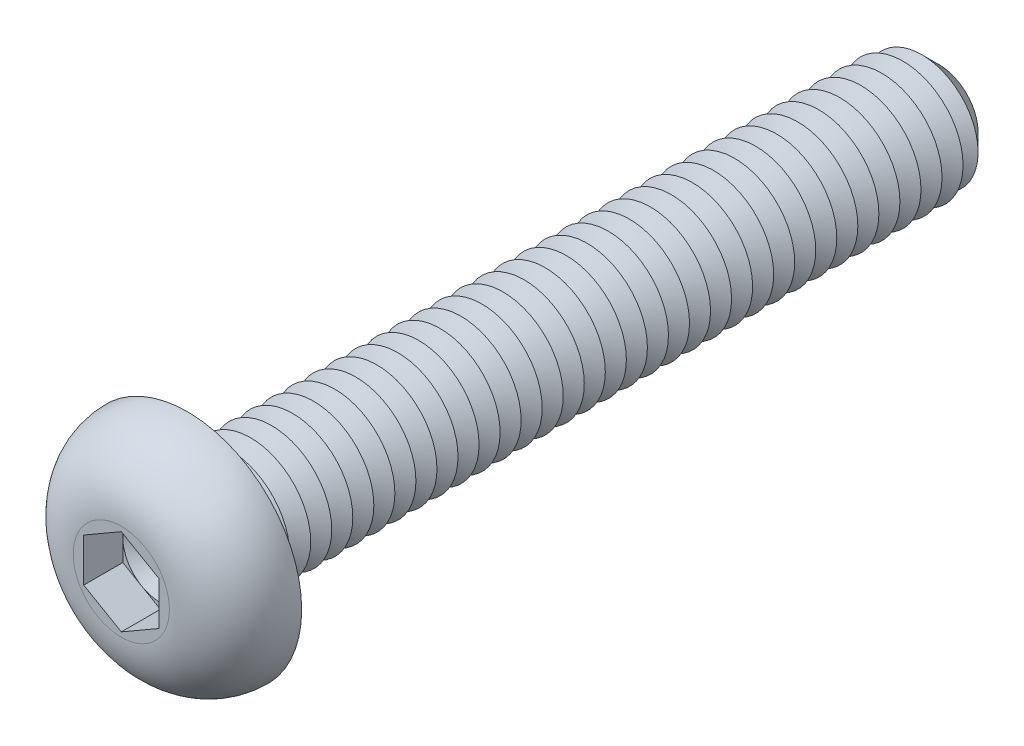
ISO-10303-21;
HEADER;
FILE_DESCRIPTION(('STEP AP214'),'2;1');
FILE_NAME('part.step','',(''),(''),'','','');
FILE_SCHEMA(('AUTOMOTIVE_DESIGN { 1 0 10303 214 1 1 1 1 }'));
ENDSEC;
DATA;
#1=APPLICATION_CONTEXT('core data for automotive mechanical design processes');
#2=APPLICATION_PROTOCOL_DEFINITION('international standard','automotive_design',2000,#1);
#3=PRODUCT_CONTEXT('',#1,'mechanical');
#4=PRODUCT('Part','Part','',(#3));
#5=PRODUCT_RELATED_PRODUCT_CATEGORY('part','',(#4));
#6=PRODUCT_DEFINITION_FORMATION('','',#4);
#7=PRODUCT_DEFINITION_CONTEXT('part definition',#1,'design');
#8=PRODUCT_DEFINITION('design','',#6,#7);
#9=PRODUCT_DEFINITION_SHAPE('','',#8);
#10=(LENGTH_UNIT() NAMED_UNIT(*) SI_UNIT(.MILLI.,.METRE.));
#11=(NAMED_UNIT(*) PLANE_ANGLE_UNIT() SI_UNIT($,.RADIAN.));
#12=(NAMED_UNIT(*) SI_UNIT($,.STERADIAN.) SOLID_ANGLE_UNIT());
#13=UNCERTAINTY_MEASURE_WITH_UNIT(LENGTH_MEASURE(1.E-05),#10,'distance_accuracy_value','');
#14=(GEOMETRIC_REPRESENTATION_CONTEXT(3) GLOBAL_UNCERTAINTY_ASSIGNED_CONTEXT((#13)) GLOBAL_UNIT_ASSIGNED_CONTEXT((#10,
#11,#12)) REPRESENTATION_CONTEXT('',''));
#15=CARTESIAN_POINT('',(0.,0.,0.));
#16=DIRECTION('',(0.,0.,1.));
#17=DIRECTION('',(1.,0.,0.));
#18=AXIS2_PLACEMENT_3D('',#15,#16,#17);
#19=CARTESIAN_POINT('',(0.,0.,0.900000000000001));
#20=DIRECTION('',(0.,0.,1.));
#21=DIRECTION('',(1.,0.,0.));
#22=AXIS2_PLACEMENT_3D('',#19,#20,#21);
#23=PLANE('',#22);
#24=CARTESIAN_POINT('',(0.,0.,0.900000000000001));
#25=DIRECTION('',(0.,0.,1.));
#26=DIRECTION('',(1.,0.,0.));
#27=AXIS2_PLACEMENT_3D('',#24,#25,#26);
#28=CIRCLE('',#27,1.25);
#29=CARTESIAN_POINT('',(1.25,0.,0.900000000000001));
#30=VERTEX_POINT('',#29);
#31=CARTESIAN_POINT('',(0.625,1.08253175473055,0.900000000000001));
#32=VERTEX_POINT('',#31);
#33=EDGE_CURVE('E117',#30,#32,#28,.T.);
#34=ORIENTED_EDGE('',*,*,#33,.F.);
#35=DIRECTION('',(0.,1.,0.));
#36=VECTOR('',#35,1.);
#37=CARTESIAN_POINT('',(1.25,-0.721687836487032,0.900000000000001));
#38=LINE('',#37,#36);
#39=CARTESIAN_POINT('',(1.25,0.721687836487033,0.900000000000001));
#40=VERTEX_POINT('',#39);
#41=EDGE_CURVE('E140',#30,#40,#38,.T.);
#42=ORIENTED_EDGE('',*,*,#41,.T.);
#43=DIRECTION('',(-0.866025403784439,0.5,0.));
#44=VECTOR('',#43,1.);
#45=CARTESIAN_POINT('',(1.25,0.721687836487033,0.900000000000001));
#46=LINE('',#45,#44);
#47=EDGE_CURVE('E135',#40,#32,#46,.T.);
#48=ORIENTED_EDGE('',*,*,#47,.T.);
#49=EDGE_LOOP('',(#34,#42,#48));
#50=FACE_BOUND('',#49,.T.);
#51=ADVANCED_FACE('F39',(#50),#23,.T.);
#52=CARTESIAN_POINT('',(0.,0.,0.900000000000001));
#53=DIRECTION('',(0.,0.,1.));
#54=DIRECTION('',(1.,0.,0.));
#55=AXIS2_PLACEMENT_3D('',#52,#53,#54);
#56=CIRCLE('',#55,1.25);
#57=CARTESIAN_POINT('',(-0.625,1.08253175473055,0.900000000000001));
#58=VERTEX_POINT('',#57);
#59=EDGE_CURVE('E11',#32,#58,#56,.T.);
#60=ORIENTED_EDGE('',*,*,#59,.F.);
#61=CARTESIAN_POINT('',(0.,1.44337567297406,0.900000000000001));
#62=VERTEX_POINT('',#61);
#63=EDGE_CURVE('E130',#32,#62,#46,.T.);
#64=ORIENTED_EDGE('',*,*,#63,.T.);
#65=DIRECTION('',(-0.866025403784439,-0.5,0.));
#66=VECTOR('',#65,1.);
#67=CARTESIAN_POINT('',(0.,1.44337567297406,0.900000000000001));
#68=LINE('',#67,#66);
#69=EDGE_CURVE('E132',#62,#58,#68,.T.);
#70=ORIENTED_EDGE('',*,*,#69,.T.);
#71=EDGE_LOOP('',(#60,#64,#70));
#72=FACE_BOUND('',#71,.T.);
#73=ADVANCED_FACE('F129',(#72),#23,.T.);
#74=CARTESIAN_POINT('',(-1.25,0.,0.900000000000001));
#75=VERTEX_POINT('',#74);
#76=EDGE_CURVE('E49',#58,#75,#56,.T.);
#77=ORIENTED_EDGE('',*,*,#76,.F.);
#78=CARTESIAN_POINT('',(-1.25,0.721687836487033,0.900000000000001));
#79=VERTEX_POINT('',#78);
#80=EDGE_CURVE('E143',#58,#79,#68,.T.);
#81=ORIENTED_EDGE('',*,*,#80,.T.);
#82=DIRECTION('',(0.,-1.,0.));
#83=VECTOR('',#82,1.);
#84=CARTESIAN_POINT('',(-1.25,0.721687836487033,0.900000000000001));
#85=LINE('',#84,#83);
#86=EDGE_CURVE('E154',#79,#75,#85,.T.);
#87=ORIENTED_EDGE('',*,*,#86,.T.);
#88=EDGE_LOOP('',(#77,#81,#87));
#89=FACE_BOUND('',#88,.T.);
#90=ADVANCED_FACE('F257',(#89),#23,.T.);
#91=CARTESIAN_POINT('',(-0.625,-1.08253175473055,0.900000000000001));
#92=VERTEX_POINT('',#91);
#93=EDGE_CURVE('E239',#75,#92,#56,.T.);
#94=ORIENTED_EDGE('',*,*,#93,.F.);
#95=CARTESIAN_POINT('',(-1.25,-0.721687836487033,0.900000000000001));
#96=VERTEX_POINT('',#95);
#97=EDGE_CURVE('E153',#75,#96,#85,.T.);
#98=ORIENTED_EDGE('',*,*,#97,.T.);
#99=DIRECTION('',(0.866025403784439,-0.5,0.));
#100=VECTOR('',#99,1.);
#101=CARTESIAN_POINT('',(-1.25,-0.721687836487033,0.900000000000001));
#102=LINE('',#101,#100);
#103=EDGE_CURVE('E159',#96,#92,#102,.T.);
#104=ORIENTED_EDGE('',*,*,#103,.T.);
#105=EDGE_LOOP('',(#94,#98,#104));
#106=FACE_BOUND('',#105,.T.);
#107=ADVANCED_FACE('F250',(#106),#23,.T.);
#108=CARTESIAN_POINT('',(0.625,-1.08253175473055,0.900000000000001));
#109=VERTEX_POINT('',#108);
#110=EDGE_CURVE('E56',#92,#109,#56,.T.);
#111=ORIENTED_EDGE('',*,*,#110,.F.);
#112=CARTESIAN_POINT('',(0.,-1.44337567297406,0.900000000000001));
#113=VERTEX_POINT('',#112);
#114=EDGE_CURVE('E158',#92,#113,#102,.T.);
#115=ORIENTED_EDGE('',*,*,#114,.T.);
#116=DIRECTION('',(0.866025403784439,0.5,0.));
#117=VECTOR('',#116,1.);
#118=CARTESIAN_POINT('',(0.,-1.44337567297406,0.900000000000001));
#119=LINE('',#118,#117);
#120=EDGE_CURVE('E164',#113,#109,#119,.T.);
#121=ORIENTED_EDGE('',*,*,#120,.T.);
#122=EDGE_LOOP('',(#111,#115,#121));
#123=FACE_BOUND('',#122,.T.);
#124=ADVANCED_FACE('F449',(#123),#23,.T.);
#125=CARTESIAN_POINT('',(0.,0.,-25.));
#126=DIRECTION('',(0.,0.,1.));
#127=DIRECTION('',(1.,0.,0.));
#128=AXIS2_PLACEMENT_3D('',#125,#126,#127);
#129=CYLINDRICAL_SURFACE('',#128,2.);
#130=CARTESIAN_POINT('',(0.,0.,-0.300000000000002));
#131=DIRECTION('',(0.,0.,1.));
#132=DIRECTION('',(1.,0.,0.));
#133=AXIS2_PLACEMENT_3D('',#130,#131,#132);
#134=CIRCLE('',#133,2.);
#135=CARTESIAN_POINT('',(2.,0.,-0.300000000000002));
#136=VERTEX_POINT('',#135);
#137=EDGE_CURVE('E222',#136,#136,#134,.F.);
#138=ORIENTED_EDGE('',*,*,#137,.T.);
#139=EDGE_LOOP('',(#138));
#140=FACE_BOUND('',#139,.T.);
#141=CARTESIAN_POINT('',(0.,0.,-0.699999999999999));
#142=DIRECTION('',(0.,0.,1.));
#143=DIRECTION('',(1.,0.,0.));
#144=AXIS2_PLACEMENT_3D('',#141,#142,#143);
#145=CIRCLE('',#144,2.);
#146=CARTESIAN_POINT('',(2.,0.,-0.699999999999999));
#147=VERTEX_POINT('',#146);
#148=EDGE_CURVE('E149',#147,#147,#145,.T.);
#149=ORIENTED_EDGE('',*,*,#148,.T.);
#150=EDGE_LOOP('',(#149));
#151=FACE_BOUND('',#150,.T.);
#152=ADVANCED_FACE('F433',(#140,#151),#129,.T.);
#153=CARTESIAN_POINT('',(0.,3.8,0.));
#154=DIRECTION('',(0.,0.,1.));
#155=DIRECTION('',(1.,0.,0.));
#156=AXIS2_PLACEMENT_3D('',#153,#154,#155);
#157=PLANE('',#156);
#158=CARTESIAN_POINT('',(0.,0.,0.));
#159=DIRECTION('',(0.,0.,1.));
#160=DIRECTION('',(1.,0.,0.));
#161=AXIS2_PLACEMENT_3D('',#158,#159,#160);
#162=CIRCLE('',#161,2.3);
#163=CARTESIAN_POINT('',(2.3,0.,0.));
#164=VERTEX_POINT('',#163);
#165=EDGE_CURVE('E230',#164,#164,#162,.T.);
#166=ORIENTED_EDGE('',*,*,#165,.T.);
#167=EDGE_LOOP('',(#166));
#168=FACE_BOUND('',#167,.T.);
#169=CARTESIAN_POINT('',(0.,0.,0.));
#170=DIRECTION('',(0.,0.,1.));
#171=DIRECTION('',(1.,0.,0.));
#172=AXIS2_PLACEMENT_3D('',#169,#170,#171);
#173=CIRCLE('',#172,3.8);
#174=CARTESIAN_POINT('',(3.8,0.,0.));
#175=VERTEX_POINT('',#174);
#176=EDGE_CURVE('E196',#175,#175,#173,.T.);
#177=ORIENTED_EDGE('',*,*,#176,.F.);
#178=EDGE_LOOP('',(#177));
#179=FACE_BOUND('',#178,.T.);
#180=ADVANCED_FACE('F479',(#168,#179),#157,.F.);
#181=CARTESIAN_POINT('',(0.,0.,2.2));
#182=DIRECTION('',(0.,0.,-1.));
#183=DIRECTION('',(-1.,0.,0.));
#184=AXIS2_PLACEMENT_3D('',#181,#182,#183);
#185=PLANE('',#184);
#186=DIRECTION('',(-0.866025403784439,-0.5,0.));
#187=VECTOR('',#186,1.);
#188=CARTESIAN_POINT('',(0.,1.44337567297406,2.2));
#189=LINE('',#188,#187);
#190=CARTESIAN_POINT('',(0.,1.44337567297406,2.2));
#191=VERTEX_POINT('',#190);
#192=CARTESIAN_POINT('',(-1.25,0.721687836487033,2.2));
#193=VERTEX_POINT('',#192);
#194=EDGE_CURVE('E174',#191,#193,#189,.T.);
#195=ORIENTED_EDGE('',*,*,#194,.F.);
#196=DIRECTION('',(-0.866025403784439,0.5,0.));
#197=VECTOR('',#196,1.);
#198=CARTESIAN_POINT('',(1.25,0.721687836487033,2.2));
#199=LINE('',#198,#197);
#200=CARTESIAN_POINT('',(1.25,0.721687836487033,2.2));
#201=VERTEX_POINT('',#200);
#202=EDGE_CURVE('E64',#201,#191,#199,.T.);
#203=ORIENTED_EDGE('',*,*,#202,.F.);
#204=DIRECTION('',(0.,1.,0.));
#205=VECTOR('',#204,1.);
#206=CARTESIAN_POINT('',(1.25,-0.721687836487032,2.2));
#207=LINE('',#206,#205);
#208=CARTESIAN_POINT('',(1.25,-0.721687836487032,2.2));
#209=VERTEX_POINT('',#208);
#210=EDGE_CURVE('E138',#209,#201,#207,.T.);
#211=ORIENTED_EDGE('',*,*,#210,.F.);
#212=DIRECTION('',(0.866025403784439,0.5,0.));
#213=VECTOR('',#212,1.);
#214=CARTESIAN_POINT('',(0.,-1.44337567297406,2.2));
#215=LINE('',#214,#213);
#216=CARTESIAN_POINT('',(0.,-1.44337567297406,2.2));
#217=VERTEX_POINT('',#216);
#218=EDGE_CURVE('E186',#217,#209,#215,.T.);
#219=ORIENTED_EDGE('',*,*,#218,.F.);
#220=DIRECTION('',(0.866025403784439,-0.5,0.));
#221=VECTOR('',#220,1.);
#222=CARTESIAN_POINT('',(-1.25,-0.721687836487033,2.2));
#223=LINE('',#222,#221);
#224=CARTESIAN_POINT('',(-1.25,-0.721687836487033,2.2));
#225=VERTEX_POINT('',#224);
#226=EDGE_CURVE('E182',#225,#217,#223,.T.);
#227=ORIENTED_EDGE('',*,*,#226,.F.);
#228=DIRECTION('',(0.,-1.,0.));
#229=VECTOR('',#228,1.);
#230=CARTESIAN_POINT('',(-1.25,0.721687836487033,2.2));
#231=LINE('',#230,#229);
#232=EDGE_CURVE('E178',#193,#225,#231,.T.);
#233=ORIENTED_EDGE('',*,*,#232,.F.);
#234=EDGE_LOOP('',(#195,#203,#211,#219,#227,#233));
#235=FACE_BOUND('',#234,.T.);
#236=CARTESIAN_POINT('',(0.,0.,2.2));
#237=DIRECTION('',(0.,0.,1.));
#238=DIRECTION('',(1.,0.,0.));
#239=AXIS2_PLACEMENT_3D('',#236,#237,#238);
#240=CIRCLE('',#239,1.6);
#241=CARTESIAN_POINT('',(1.6,0.,2.2));
#242=VERTEX_POINT('',#241);
#243=EDGE_CURVE('E214',#242,#242,#240,.T.);
#244=ORIENTED_EDGE('',*,*,#243,.T.);
#245=EDGE_LOOP('',(#244));
#246=FACE_BOUND('',#245,.T.);
#247=ADVANCED_FACE('F266',(#235,#246),#185,.F.);
#248=CARTESIAN_POINT('',(0.,0.,0.));
#249=DIRECTION('',(0.,0.,1.));
#250=DIRECTION('',(1.,0.,0.));
#251=AXIS2_PLACEMENT_3D('',#248,#249,#250);
#252=DEGENERATE_TOROIDAL_SURFACE('',#251,1.6,2.2,.T.);
#253=ORIENTED_EDGE('',*,*,#243,.F.);
#254=EDGE_LOOP('',(#253));
#255=FACE_BOUND('',#254,.T.);
#256=ORIENTED_EDGE('',*,*,#176,.T.);
#257=EDGE_LOOP('',(#256));
#258=FACE_BOUND('',#257,.T.);
#259=ADVANCED_FACE('F473',(#255,#258),#252,.T.);
#260=CARTESIAN_POINT('',(1.25,0.721687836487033,0.900000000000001));
#261=DIRECTION('',(0.5,0.866025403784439,0.));
#262=DIRECTION('',(-0.866025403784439,0.5,0.));
#263=AXIS2_PLACEMENT_3D('',#260,#261,#262);
#264=PLANE('',#263);
#265=ORIENTED_EDGE('',*,*,#202,.T.);
#266=DIRECTION('',(0.,0.,1.));
#267=VECTOR('',#266,1.);
#268=CARTESIAN_POINT('',(0.,1.44337567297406,0.900000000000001));
#269=LINE('',#268,#267);
#270=EDGE_CURVE('E136',#62,#191,#269,.T.);
#271=ORIENTED_EDGE('',*,*,#270,.F.);
#272=ORIENTED_EDGE('',*,*,#63,.F.);
#273=ORIENTED_EDGE('',*,*,#47,.F.);
#274=DIRECTION('',(0.,0.,1.));
#275=VECTOR('',#274,1.);
#276=CARTESIAN_POINT('',(1.25,0.721687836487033,0.900000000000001));
#277=LINE('',#276,#275);
#278=EDGE_CURVE('E193',#40,#201,#277,.T.);
#279=ORIENTED_EDGE('',*,*,#278,.T.);
#280=EDGE_LOOP('',(#265,#271,#272,#273,#279));
#281=FACE_BOUND('',#280,.T.);
#282=ADVANCED_FACE('F134',(#281),#264,.F.);
#283=CARTESIAN_POINT('',(1.25,-0.721687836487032,0.900000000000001));
#284=DIRECTION('',(1.,0.,0.));
#285=DIRECTION('',(0.,1.,0.));
#286=AXIS2_PLACEMENT_3D('',#283,#284,#285);
#287=PLANE('',#286);
#288=ORIENTED_EDGE('',*,*,#210,.T.);
#289=ORIENTED_EDGE('',*,*,#278,.F.);
#290=ORIENTED_EDGE('',*,*,#41,.F.);
#291=CARTESIAN_POINT('',(1.25,-0.721687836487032,0.900000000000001));
#292=VERTEX_POINT('',#291);
#293=EDGE_CURVE('E168',#292,#30,#38,.T.);
#294=ORIENTED_EDGE('',*,*,#293,.F.);
#295=DIRECTION('',(0.,0.,1.));
#296=VECTOR('',#295,1.);
#297=CARTESIAN_POINT('',(1.25,-0.721687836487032,0.900000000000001));
#298=LINE('',#297,#296);
#299=EDGE_CURVE('E197',#292,#209,#298,.T.);
#300=ORIENTED_EDGE('',*,*,#299,.T.);
#301=EDGE_LOOP('',(#288,#289,#290,#294,#300));
#302=FACE_BOUND('',#301,.T.);
#303=ADVANCED_FACE('F457',(#302),#287,.F.);
#304=CARTESIAN_POINT('',(0.,-1.44337567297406,0.900000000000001));
#305=DIRECTION('',(0.5,-0.866025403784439,0.));
#306=DIRECTION('',(0.866025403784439,0.5,0.));
#307=AXIS2_PLACEMENT_3D('',#304,#305,#306);
#308=PLANE('',#307);
#309=ORIENTED_EDGE('',*,*,#218,.T.);
#310=ORIENTED_EDGE('',*,*,#299,.F.);
#311=EDGE_CURVE('E163',#109,#292,#119,.T.);
#312=ORIENTED_EDGE('',*,*,#311,.F.);
#313=ORIENTED_EDGE('',*,*,#120,.F.);
#314=DIRECTION('',(0.,0.,1.));
#315=VECTOR('',#314,1.);
#316=CARTESIAN_POINT('',(0.,-1.44337567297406,0.900000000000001));
#317=LINE('',#316,#315);
#318=EDGE_CURVE('E200',#113,#217,#317,.T.);
#319=ORIENTED_EDGE('',*,*,#318,.T.);
#320=EDGE_LOOP('',(#309,#310,#312,#313,#319));
#321=FACE_BOUND('',#320,.T.);
#322=ADVANCED_FACE('F460',(#321),#308,.F.);
#323=CARTESIAN_POINT('',(-1.25,-0.721687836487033,0.900000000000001));
#324=DIRECTION('',(-0.5,-0.866025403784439,0.));
#325=DIRECTION('',(0.866025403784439,-0.5,0.));
#326=AXIS2_PLACEMENT_3D('',#323,#324,#325);
#327=PLANE('',#326);
#328=ORIENTED_EDGE('',*,*,#226,.T.);
#329=ORIENTED_EDGE('',*,*,#318,.F.);
#330=ORIENTED_EDGE('',*,*,#114,.F.);
#331=ORIENTED_EDGE('',*,*,#103,.F.);
#332=DIRECTION('',(0.,0.,1.));
#333=VECTOR('',#332,1.);
#334=CARTESIAN_POINT('',(-1.25,-0.721687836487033,0.900000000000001));
#335=LINE('',#334,#333);
#336=EDGE_CURVE('E203',#96,#225,#335,.T.);
#337=ORIENTED_EDGE('',*,*,#336,.T.);
#338=EDGE_LOOP('',(#328,#329,#330,#331,#337));
#339=FACE_BOUND('',#338,.T.);
#340=ADVANCED_FACE('F271',(#339),#327,.F.);
#341=CARTESIAN_POINT('',(-1.25,0.721687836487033,0.900000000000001));
#342=DIRECTION('',(-1.,0.,0.));
#343=DIRECTION('',(0.,0.,1.));
#344=AXIS2_PLACEMENT_3D('',#341,#342,#343);
#345=PLANE('',#344);
#346=ORIENTED_EDGE('',*,*,#232,.T.);
#347=ORIENTED_EDGE('',*,*,#336,.F.);
#348=ORIENTED_EDGE('',*,*,#97,.F.);
#349=ORIENTED_EDGE('',*,*,#86,.F.);
#350=DIRECTION('',(0.,0.,1.));
#351=VECTOR('',#350,1.);
#352=CARTESIAN_POINT('',(-1.25,0.721687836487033,0.900000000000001));
#353=LINE('',#352,#351);
#354=EDGE_CURVE('E206',#79,#193,#353,.T.);
#355=ORIENTED_EDGE('',*,*,#354,.T.);
#356=EDGE_LOOP('',(#346,#347,#348,#349,#355));
#357=FACE_BOUND('',#356,.T.);
#358=ADVANCED_FACE('F255',(#357),#345,.F.);
#359=CARTESIAN_POINT('',(0.,1.44337567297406,0.900000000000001));
#360=DIRECTION('',(-0.5,0.866025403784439,0.));
#361=DIRECTION('',(-0.866025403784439,-0.5,0.));
#362=AXIS2_PLACEMENT_3D('',#359,#360,#361);
#363=PLANE('',#362);
#364=ORIENTED_EDGE('',*,*,#194,.T.);
#365=ORIENTED_EDGE('',*,*,#354,.F.);
#366=ORIENTED_EDGE('',*,*,#80,.F.);
#367=ORIENTED_EDGE('',*,*,#69,.F.);
#368=ORIENTED_EDGE('',*,*,#270,.T.);
#369=EDGE_LOOP('',(#364,#365,#366,#367,#368));
#370=FACE_BOUND('',#369,.T.);
#371=ADVANCED_FACE('F260',(#370),#363,.F.);
#372=EDGE_CURVE('E43',#109,#30,#56,.T.);
#373=ORIENTED_EDGE('',*,*,#372,.F.);
#374=ORIENTED_EDGE('',*,*,#311,.T.);
#375=ORIENTED_EDGE('',*,*,#293,.T.);
#376=EDGE_LOOP('',(#373,#374,#375));
#377=FACE_BOUND('',#376,.T.);
#378=ADVANCED_FACE('F438',(#377),#23,.T.);
#379=CARTESIAN_POINT('',(0.,0.,-0.699999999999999));
#380=DIRECTION('',(0.,0.,1.));
#381=DIRECTION('',(1.,0.,0.));
#382=AXIS2_PLACEMENT_3D('',#379,#380,#381);
#383=CONICAL_SURFACE('',#382,2.,1.04719755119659);
#384=CARTESIAN_POINT('',(0.,0.,-1.05));
#385=DIRECTION('',(0.,0.,1.));
#386=DIRECTION('',(1.,0.,0.));
#387=AXIS2_PLACEMENT_3D('',#384,#385,#386);
#388=CIRCLE('',#387,1.3937822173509);
#389=CARTESIAN_POINT('',(1.3937822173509,0.,-1.05));
#390=VERTEX_POINT('',#389);
#391=EDGE_CURVE('E424',#390,#390,#388,.T.);
#392=ORIENTED_EDGE('',*,*,#391,.T.);
#393=EDGE_LOOP('',(#392));
#394=FACE_BOUND('',#393,.T.);
#395=ORIENTED_EDGE('',*,*,#148,.F.);
#396=EDGE_LOOP('',(#395));
#397=FACE_BOUND('',#396,.T.);
#398=ADVANCED_FACE('F435',(#394,#397),#383,.T.);
#399=CARTESIAN_POINT('',(0.,0.,-1.05));
#400=DIRECTION('',(0.,0.,-1.));
#401=DIRECTION('',(-1.,0.,0.));
#402=AXIS2_PLACEMENT_3D('',#399,#400,#401);
#403=CONICAL_SURFACE('',#402,1.3937822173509,1.0471975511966);
#404=CARTESIAN_POINT('',(0.,0.,-1.4));
#405=DIRECTION('',(0.,0.,1.));
#406=DIRECTION('',(1.,0.,0.));
#407=AXIS2_PLACEMENT_3D('',#404,#405,#406);
#408=CIRCLE('',#407,2.);
#409=CARTESIAN_POINT('',(2.,0.,-1.4));
#410=VERTEX_POINT('',#409);
#411=EDGE_CURVE('E421',#410,#410,#408,.T.);
#412=ORIENTED_EDGE('',*,*,#411,.T.);
#413=EDGE_LOOP('',(#412));
#414=FACE_BOUND('',#413,.T.);
#415=ORIENTED_EDGE('',*,*,#391,.F.);
#416=EDGE_LOOP('',(#415));
#417=FACE_BOUND('',#416,.T.);
#418=ADVANCED_FACE('F437',(#414,#417),#403,.T.);
#419=CARTESIAN_POINT('',(0.,0.,-1.4));
#420=DIRECTION('',(0.,0.,1.));
#421=DIRECTION('',(1.,0.,0.));
#422=AXIS2_PLACEMENT_3D('',#419,#420,#421);
#423=CONICAL_SURFACE('',#422,2.,1.04719755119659);
#424=CARTESIAN_POINT('',(0.,0.,-1.75));
#425=DIRECTION('',(0.,0.,1.));
#426=DIRECTION('',(1.,0.,0.));
#427=AXIS2_PLACEMENT_3D('',#424,#425,#426);
#428=CIRCLE('',#427,1.3937822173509);
#429=CARTESIAN_POINT('',(1.3937822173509,0.,-1.75));
#430=VERTEX_POINT('',#429);
#431=EDGE_CURVE('E417',#430,#430,#428,.T.);
#432=ORIENTED_EDGE('',*,*,#431,.T.);
#433=EDGE_LOOP('',(#432));
#434=FACE_BOUND('',#433,.T.);
#435=ORIENTED_EDGE('',*,*,#411,.F.);
#436=EDGE_LOOP('',(#435));
#437=FACE_BOUND('',#436,.T.);
#438=ADVANCED_FACE('F444',(#434,#437),#423,.T.);
#439=CARTESIAN_POINT('',(0.,0.,-1.75));
#440=DIRECTION('',(0.,0.,-1.));
#441=DIRECTION('',(-1.,0.,0.));
#442=AXIS2_PLACEMENT_3D('',#439,#440,#441);
#443=CONICAL_SURFACE('',#442,1.3937822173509,1.0471975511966);
#444=CARTESIAN_POINT('',(0.,0.,-2.1));
#445=DIRECTION('',(0.,0.,1.));
#446=DIRECTION('',(1.,0.,0.));
#447=AXIS2_PLACEMENT_3D('',#444,#445,#446);
#448=CIRCLE('',#447,2.);
#449=CARTESIAN_POINT('',(2.,0.,-2.1));
#450=VERTEX_POINT('',#449);
#451=EDGE_CURVE('E413',#450,#450,#448,.T.);
#452=ORIENTED_EDGE('',*,*,#451,.T.);
#453=EDGE_LOOP('',(#452));
#454=FACE_BOUND('',#453,.T.);
#455=ORIENTED_EDGE('',*,*,#431,.F.);
#456=EDGE_LOOP('',(#455));
#457=FACE_BOUND('',#456,.T.);
#458=ADVANCED_FACE('F750',(#454,#457),#443,.T.);
#459=CARTESIAN_POINT('',(0.,0.,-2.1));
#460=DIRECTION('',(0.,0.,1.));
#461=DIRECTION('',(1.,0.,0.));
#462=AXIS2_PLACEMENT_3D('',#459,#460,#461);
#463=CONICAL_SURFACE('',#462,2.,1.04719755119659);
#464=CARTESIAN_POINT('',(0.,0.,-2.45));
#465=DIRECTION('',(0.,0.,1.));
#466=DIRECTION('',(1.,0.,0.));
#467=AXIS2_PLACEMENT_3D('',#464,#465,#466);
#468=CIRCLE('',#467,1.3937822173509);
#469=CARTESIAN_POINT('',(1.3937822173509,0.,-2.45));
#470=VERTEX_POINT('',#469);
#471=EDGE_CURVE('E409',#470,#470,#468,.T.);
#472=ORIENTED_EDGE('',*,*,#471,.T.);
#473=EDGE_LOOP('',(#472));
#474=FACE_BOUND('',#473,.T.);
#475=ORIENTED_EDGE('',*,*,#451,.F.);
#476=EDGE_LOOP('',(#475));
#477=FACE_BOUND('',#476,.T.);
#478=ADVANCED_FACE('F746',(#474,#477),#463,.T.);
#479=CARTESIAN_POINT('',(0.,0.,-2.45));
#480=DIRECTION('',(0.,0.,-1.));
#481=DIRECTION('',(-1.,0.,0.));
#482=AXIS2_PLACEMENT_3D('',#479,#480,#481);
#483=CONICAL_SURFACE('',#482,1.3937822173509,1.0471975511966);
#484=CARTESIAN_POINT('',(0.,0.,-2.8));
#485=DIRECTION('',(0.,0.,1.));
#486=DIRECTION('',(1.,0.,0.));
#487=AXIS2_PLACEMENT_3D('',#484,#485,#486);
#488=CIRCLE('',#487,2.);
#489=CARTESIAN_POINT('',(2.,0.,-2.8));
#490=VERTEX_POINT('',#489);
#491=EDGE_CURVE('E405',#490,#490,#488,.T.);
#492=ORIENTED_EDGE('',*,*,#491,.T.);
#493=EDGE_LOOP('',(#492));
#494=FACE_BOUND('',#493,.T.);
#495=ORIENTED_EDGE('',*,*,#471,.F.);
#496=EDGE_LOOP('',(#495));
#497=FACE_BOUND('',#496,.T.);
#498=ADVANCED_FACE('F742',(#494,#497),#483,.T.);
#499=CARTESIAN_POINT('',(0.,0.,-2.8));
#500=DIRECTION('',(0.,0.,1.));
#501=DIRECTION('',(1.,0.,0.));
#502=AXIS2_PLACEMENT_3D('',#499,#500,#501);
#503=CONICAL_SURFACE('',#502,2.,1.04719755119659);
#504=CARTESIAN_POINT('',(0.,0.,-3.15));
#505=DIRECTION('',(0.,0.,1.));
#506=DIRECTION('',(1.,0.,0.));
#507=AXIS2_PLACEMENT_3D('',#504,#505,#506);
#508=CIRCLE('',#507,1.3937822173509);
#509=CARTESIAN_POINT('',(1.3937822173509,0.,-3.15));
#510=VERTEX_POINT('',#509);
#511=EDGE_CURVE('E401',#510,#510,#508,.T.);
#512=ORIENTED_EDGE('',*,*,#511,.T.);
#513=EDGE_LOOP('',(#512));
#514=FACE_BOUND('',#513,.T.);
#515=ORIENTED_EDGE('',*,*,#491,.F.);
#516=EDGE_LOOP('',(#515));
#517=FACE_BOUND('',#516,.T.);
#518=ADVANCED_FACE('F738',(#514,#517),#503,.T.);
#519=CARTESIAN_POINT('',(0.,0.,-3.15));
#520=DIRECTION('',(0.,0.,-1.));
#521=DIRECTION('',(-1.,0.,0.));
#522=AXIS2_PLACEMENT_3D('',#519,#520,#521);
#523=CONICAL_SURFACE('',#522,1.3937822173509,1.0471975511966);
#524=CARTESIAN_POINT('',(0.,0.,-3.5));
#525=DIRECTION('',(0.,0.,1.));
#526=DIRECTION('',(1.,0.,0.));
#527=AXIS2_PLACEMENT_3D('',#524,#525,#526);
#528=CIRCLE('',#527,2.);
#529=CARTESIAN_POINT('',(2.,0.,-3.5));
#530=VERTEX_POINT('',#529);
#531=EDGE_CURVE('E397',#530,#530,#528,.T.);
#532=ORIENTED_EDGE('',*,*,#531,.T.);
#533=EDGE_LOOP('',(#532));
#534=FACE_BOUND('',#533,.T.);
#535=ORIENTED_EDGE('',*,*,#511,.F.);
#536=EDGE_LOOP('',(#535));
#537=FACE_BOUND('',#536,.T.);
#538=ADVANCED_FACE('F734',(#534,#537),#523,.T.);
#539=CARTESIAN_POINT('',(0.,0.,-3.5));
#540=DIRECTION('',(0.,0.,1.));
#541=DIRECTION('',(1.,0.,0.));
#542=AXIS2_PLACEMENT_3D('',#539,#540,#541);
#543=CONICAL_SURFACE('',#542,2.,1.04719755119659);
#544=CARTESIAN_POINT('',(0.,0.,-3.85));
#545=DIRECTION('',(0.,0.,1.));
#546=DIRECTION('',(1.,0.,0.));
#547=AXIS2_PLACEMENT_3D('',#544,#545,#546);
#548=CIRCLE('',#547,1.3937822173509);
#549=CARTESIAN_POINT('',(1.3937822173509,0.,-3.85));
#550=VERTEX_POINT('',#549);
#551=EDGE_CURVE('E393',#550,#550,#548,.T.);
#552=ORIENTED_EDGE('',*,*,#551,.T.);
#553=EDGE_LOOP('',(#552));
#554=FACE_BOUND('',#553,.T.);
#555=ORIENTED_EDGE('',*,*,#531,.F.);
#556=EDGE_LOOP('',(#555));
#557=FACE_BOUND('',#556,.T.);
#558=ADVANCED_FACE('F730',(#554,#557),#543,.T.);
#559=CARTESIAN_POINT('',(0.,0.,-3.85));
#560=DIRECTION('',(0.,0.,-1.));
#561=DIRECTION('',(-1.,0.,0.));
#562=AXIS2_PLACEMENT_3D('',#559,#560,#561);
#563=CONICAL_SURFACE('',#562,1.3937822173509,1.0471975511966);
#564=CARTESIAN_POINT('',(0.,0.,-4.2));
#565=DIRECTION('',(0.,0.,1.));
#566=DIRECTION('',(1.,0.,0.));
#567=AXIS2_PLACEMENT_3D('',#564,#565,#566);
#568=CIRCLE('',#567,2.);
#569=CARTESIAN_POINT('',(2.,0.,-4.2));
#570=VERTEX_POINT('',#569);
#571=EDGE_CURVE('E389',#570,#570,#568,.T.);
#572=ORIENTED_EDGE('',*,*,#571,.T.);
#573=EDGE_LOOP('',(#572));
#574=FACE_BOUND('',#573,.T.);
#575=ORIENTED_EDGE('',*,*,#551,.F.);
#576=EDGE_LOOP('',(#575));
#577=FACE_BOUND('',#576,.T.);
#578=ADVANCED_FACE('F726',(#574,#577),#563,.T.);
#579=CARTESIAN_POINT('',(0.,0.,-4.2));
#580=DIRECTION('',(0.,0.,1.));
#581=DIRECTION('',(1.,0.,0.));
#582=AXIS2_PLACEMENT_3D('',#579,#580,#581);
#583=CONICAL_SURFACE('',#582,2.,1.04719755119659);
#584=CARTESIAN_POINT('',(0.,0.,-4.55));
#585=DIRECTION('',(0.,0.,1.));
#586=DIRECTION('',(1.,0.,0.));
#587=AXIS2_PLACEMENT_3D('',#584,#585,#586);
#588=CIRCLE('',#587,1.3937822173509);
#589=CARTESIAN_POINT('',(1.3937822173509,0.,-4.55));
#590=VERTEX_POINT('',#589);
#591=EDGE_CURVE('E385',#590,#590,#588,.T.);
#592=ORIENTED_EDGE('',*,*,#591,.T.);
#593=EDGE_LOOP('',(#592));
#594=FACE_BOUND('',#593,.T.);
#595=ORIENTED_EDGE('',*,*,#571,.F.);
#596=EDGE_LOOP('',(#595));
#597=FACE_BOUND('',#596,.T.);
#598=ADVANCED_FACE('F722',(#594,#597),#583,.T.);
#599=CARTESIAN_POINT('',(0.,0.,-4.55));
#600=DIRECTION('',(0.,0.,-1.));
#601=DIRECTION('',(-1.,0.,0.));
#602=AXIS2_PLACEMENT_3D('',#599,#600,#601);
#603=CONICAL_SURFACE('',#602,1.3937822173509,1.0471975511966);
#604=CARTESIAN_POINT('',(0.,0.,-4.9));
#605=DIRECTION('',(0.,0.,1.));
#606=DIRECTION('',(1.,0.,0.));
#607=AXIS2_PLACEMENT_3D('',#604,#605,#606);
#608=CIRCLE('',#607,2.);
#609=CARTESIAN_POINT('',(2.,0.,-4.9));
#610=VERTEX_POINT('',#609);
#611=EDGE_CURVE('E382',#610,#610,#608,.T.);
#612=ORIENTED_EDGE('',*,*,#611,.T.);
#613=EDGE_LOOP('',(#612));
#614=FACE_BOUND('',#613,.T.);
#615=ORIENTED_EDGE('',*,*,#591,.F.);
#616=EDGE_LOOP('',(#615));
#617=FACE_BOUND('',#616,.T.);
#618=ADVANCED_FACE('F718',(#614,#617),#603,.T.);
#619=CARTESIAN_POINT('',(0.,0.,-4.9));
#620=DIRECTION('',(0.,0.,1.));
#621=DIRECTION('',(1.,0.,0.));
#622=AXIS2_PLACEMENT_3D('',#619,#620,#621);
#623=CONICAL_SURFACE('',#622,2.,1.04719755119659);
#624=CARTESIAN_POINT('',(0.,0.,-5.25));
#625=DIRECTION('',(0.,0.,1.));
#626=DIRECTION('',(1.,0.,0.));
#627=AXIS2_PLACEMENT_3D('',#624,#625,#626);
#628=CIRCLE('',#627,1.3937822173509);
#629=CARTESIAN_POINT('',(1.3937822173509,0.,-5.25));
#630=VERTEX_POINT('',#629);
#631=EDGE_CURVE('E378',#630,#630,#628,.T.);
#632=ORIENTED_EDGE('',*,*,#631,.T.);
#633=EDGE_LOOP('',(#632));
#634=FACE_BOUND('',#633,.T.);
#635=ORIENTED_EDGE('',*,*,#611,.F.);
#636=EDGE_LOOP('',(#635));
#637=FACE_BOUND('',#636,.T.);
#638=ADVANCED_FACE('F714',(#634,#637),#623,.T.);
#639=CARTESIAN_POINT('',(0.,0.,-5.25));
#640=DIRECTION('',(0.,0.,-1.));
#641=DIRECTION('',(-1.,0.,0.));
#642=AXIS2_PLACEMENT_3D('',#639,#640,#641);
#643=CONICAL_SURFACE('',#642,1.3937822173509,1.0471975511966);
#644=CARTESIAN_POINT('',(0.,0.,-5.6));
#645=DIRECTION('',(0.,0.,1.));
#646=DIRECTION('',(1.,0.,0.));
#647=AXIS2_PLACEMENT_3D('',#644,#645,#646);
#648=CIRCLE('',#647,2.);
#649=CARTESIAN_POINT('',(2.,0.,-5.6));
#650=VERTEX_POINT('',#649);
#651=EDGE_CURVE('E375',#650,#650,#648,.T.);
#652=ORIENTED_EDGE('',*,*,#651,.T.);
#653=EDGE_LOOP('',(#652));
#654=FACE_BOUND('',#653,.T.);
#655=ORIENTED_EDGE('',*,*,#631,.F.);
#656=EDGE_LOOP('',(#655));
#657=FACE_BOUND('',#656,.T.);
#658=ADVANCED_FACE('F710',(#654,#657),#643,.T.);
#659=CARTESIAN_POINT('',(0.,0.,-5.6));
#660=DIRECTION('',(0.,0.,1.));
#661=DIRECTION('',(1.,0.,0.));
#662=AXIS2_PLACEMENT_3D('',#659,#660,#661);
#663=CONICAL_SURFACE('',#662,2.,1.04719755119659);
#664=CARTESIAN_POINT('',(0.,0.,-5.95));
#665=DIRECTION('',(0.,0.,1.));
#666=DIRECTION('',(1.,0.,0.));
#667=AXIS2_PLACEMENT_3D('',#664,#665,#666);
#668=CIRCLE('',#667,1.3937822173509);
#669=CARTESIAN_POINT('',(1.3937822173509,0.,-5.95));
#670=VERTEX_POINT('',#669);
#671=EDGE_CURVE('E371',#670,#670,#668,.T.);
#672=ORIENTED_EDGE('',*,*,#671,.T.);
#673=EDGE_LOOP('',(#672));
#674=FACE_BOUND('',#673,.T.);
#675=ORIENTED_EDGE('',*,*,#651,.F.);
#676=EDGE_LOOP('',(#675));
#677=FACE_BOUND('',#676,.T.);
#678=ADVANCED_FACE('F706',(#674,#677),#663,.T.);
#679=CARTESIAN_POINT('',(0.,0.,-5.95));
#680=DIRECTION('',(0.,0.,-1.));
#681=DIRECTION('',(-1.,0.,0.));
#682=AXIS2_PLACEMENT_3D('',#679,#680,#681);
#683=CONICAL_SURFACE('',#682,1.3937822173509,1.0471975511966);
#684=CARTESIAN_POINT('',(0.,0.,-6.3));
#685=DIRECTION('',(0.,0.,1.));
#686=DIRECTION('',(1.,0.,0.));
#687=AXIS2_PLACEMENT_3D('',#684,#685,#686);
#688=CIRCLE('',#687,2.);
#689=CARTESIAN_POINT('',(2.,0.,-6.3));
#690=VERTEX_POINT('',#689);
#691=EDGE_CURVE('E367',#690,#690,#688,.T.);
#692=ORIENTED_EDGE('',*,*,#691,.T.);
#693=EDGE_LOOP('',(#692));
#694=FACE_BOUND('',#693,.T.);
#695=ORIENTED_EDGE('',*,*,#671,.F.);
#696=EDGE_LOOP('',(#695));
#697=FACE_BOUND('',#696,.T.);
#698=ADVANCED_FACE('F702',(#694,#697),#683,.T.);
#699=CARTESIAN_POINT('',(0.,0.,-6.3));
#700=DIRECTION('',(0.,0.,1.));
#701=DIRECTION('',(1.,0.,0.));
#702=AXIS2_PLACEMENT_3D('',#699,#700,#701);
#703=CONICAL_SURFACE('',#702,2.,1.04719755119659);
#704=CARTESIAN_POINT('',(0.,0.,-6.65));
#705=DIRECTION('',(0.,0.,1.));
#706=DIRECTION('',(1.,0.,0.));
#707=AXIS2_PLACEMENT_3D('',#704,#705,#706);
#708=CIRCLE('',#707,1.3937822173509);
#709=CARTESIAN_POINT('',(1.3937822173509,0.,-6.65));
#710=VERTEX_POINT('',#709);
#711=EDGE_CURVE('E363',#710,#710,#708,.T.);
#712=ORIENTED_EDGE('',*,*,#711,.T.);
#713=EDGE_LOOP('',(#712));
#714=FACE_BOUND('',#713,.T.);
#715=ORIENTED_EDGE('',*,*,#691,.F.);
#716=EDGE_LOOP('',(#715));
#717=FACE_BOUND('',#716,.T.);
#718=ADVANCED_FACE('F698',(#714,#717),#703,.T.);
#719=CARTESIAN_POINT('',(0.,0.,-6.65));
#720=DIRECTION('',(0.,0.,-1.));
#721=DIRECTION('',(-1.,0.,0.));
#722=AXIS2_PLACEMENT_3D('',#719,#720,#721);
#723=CONICAL_SURFACE('',#722,1.3937822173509,1.0471975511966);
#724=CARTESIAN_POINT('',(0.,0.,-7.));
#725=DIRECTION('',(0.,0.,1.));
#726=DIRECTION('',(1.,0.,0.));
#727=AXIS2_PLACEMENT_3D('',#724,#725,#726);
#728=CIRCLE('',#727,2.);
#729=CARTESIAN_POINT('',(2.,0.,-7.));
#730=VERTEX_POINT('',#729);
#731=EDGE_CURVE('E359',#730,#730,#728,.T.);
#732=ORIENTED_EDGE('',*,*,#731,.T.);
#733=EDGE_LOOP('',(#732));
#734=FACE_BOUND('',#733,.T.);
#735=ORIENTED_EDGE('',*,*,#711,.F.);
#736=EDGE_LOOP('',(#735));
#737=FACE_BOUND('',#736,.T.);
#738=ADVANCED_FACE('F694',(#734,#737),#723,.T.);
#739=CARTESIAN_POINT('',(0.,0.,-7.));
#740=DIRECTION('',(0.,0.,1.));
#741=DIRECTION('',(1.,0.,0.));
#742=AXIS2_PLACEMENT_3D('',#739,#740,#741);
#743=CONICAL_SURFACE('',#742,2.,1.04719755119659);
#744=CARTESIAN_POINT('',(0.,0.,-7.35));
#745=DIRECTION('',(0.,0.,1.));
#746=DIRECTION('',(1.,0.,0.));
#747=AXIS2_PLACEMENT_3D('',#744,#745,#746);
#748=CIRCLE('',#747,1.3937822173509);
#749=CARTESIAN_POINT('',(1.3937822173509,0.,-7.35));
#750=VERTEX_POINT('',#749);
#751=EDGE_CURVE('E355',#750,#750,#748,.T.);
#752=ORIENTED_EDGE('',*,*,#751,.T.);
#753=EDGE_LOOP('',(#752));
#754=FACE_BOUND('',#753,.T.);
#755=ORIENTED_EDGE('',*,*,#731,.F.);
#756=EDGE_LOOP('',(#755));
#757=FACE_BOUND('',#756,.T.);
#758=ADVANCED_FACE('F690',(#754,#757),#743,.T.);
#759=CARTESIAN_POINT('',(0.,0.,-7.35));
#760=DIRECTION('',(0.,0.,-1.));
#761=DIRECTION('',(-1.,0.,0.));
#762=AXIS2_PLACEMENT_3D('',#759,#760,#761);
#763=CONICAL_SURFACE('',#762,1.3937822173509,1.0471975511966);
#764=CARTESIAN_POINT('',(0.,0.,-7.7));
#765=DIRECTION('',(0.,0.,1.));
#766=DIRECTION('',(1.,0.,0.));
#767=AXIS2_PLACEMENT_3D('',#764,#765,#766);
#768=CIRCLE('',#767,2.);
#769=CARTESIAN_POINT('',(2.,0.,-7.7));
#770=VERTEX_POINT('',#769);
#771=EDGE_CURVE('E351',#770,#770,#768,.T.);
#772=ORIENTED_EDGE('',*,*,#771,.T.);
#773=EDGE_LOOP('',(#772));
#774=FACE_BOUND('',#773,.T.);
#775=ORIENTED_EDGE('',*,*,#751,.F.);
#776=EDGE_LOOP('',(#775));
#777=FACE_BOUND('',#776,.T.);
#778=ADVANCED_FACE('F686',(#774,#777),#763,.T.);
#779=CARTESIAN_POINT('',(0.,0.,-7.7));
#780=DIRECTION('',(0.,0.,1.));
#781=DIRECTION('',(1.,0.,0.));
#782=AXIS2_PLACEMENT_3D('',#779,#780,#781);
#783=CONICAL_SURFACE('',#782,2.,1.04719755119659);
#784=CARTESIAN_POINT('',(0.,0.,-8.05));
#785=DIRECTION('',(0.,0.,1.));
#786=DIRECTION('',(1.,0.,0.));
#787=AXIS2_PLACEMENT_3D('',#784,#785,#786);
#788=CIRCLE('',#787,1.3937822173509);
#789=CARTESIAN_POINT('',(1.3937822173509,0.,-8.05));
#790=VERTEX_POINT('',#789);
#791=EDGE_CURVE('E347',#790,#790,#788,.T.);
#792=ORIENTED_EDGE('',*,*,#791,.T.);
#793=EDGE_LOOP('',(#792));
#794=FACE_BOUND('',#793,.T.);
#795=ORIENTED_EDGE('',*,*,#771,.F.);
#796=EDGE_LOOP('',(#795));
#797=FACE_BOUND('',#796,.T.);
#798=ADVANCED_FACE('F682',(#794,#797),#783,.T.);
#799=CARTESIAN_POINT('',(0.,0.,-8.05));
#800=DIRECTION('',(0.,0.,-1.));
#801=DIRECTION('',(-1.,0.,0.));
#802=AXIS2_PLACEMENT_3D('',#799,#800,#801);
#803=CONICAL_SURFACE('',#802,1.3937822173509,1.0471975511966);
#804=CARTESIAN_POINT('',(0.,0.,-8.4));
#805=DIRECTION('',(0.,0.,1.));
#806=DIRECTION('',(1.,0.,0.));
#807=AXIS2_PLACEMENT_3D('',#804,#805,#806);
#808=CIRCLE('',#807,2.);
#809=CARTESIAN_POINT('',(2.,0.,-8.4));
#810=VERTEX_POINT('',#809);
#811=EDGE_CURVE('E343',#810,#810,#808,.T.);
#812=ORIENTED_EDGE('',*,*,#811,.T.);
#813=EDGE_LOOP('',(#812));
#814=FACE_BOUND('',#813,.T.);
#815=ORIENTED_EDGE('',*,*,#791,.F.);
#816=EDGE_LOOP('',(#815));
#817=FACE_BOUND('',#816,.T.);
#818=ADVANCED_FACE('F678',(#814,#817),#803,.T.);
#819=CARTESIAN_POINT('',(0.,0.,-8.4));
#820=DIRECTION('',(0.,0.,1.));
#821=DIRECTION('',(1.,0.,0.));
#822=AXIS2_PLACEMENT_3D('',#819,#820,#821);
#823=CONICAL_SURFACE('',#822,2.,1.04719755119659);
#824=CARTESIAN_POINT('',(0.,0.,-8.75));
#825=DIRECTION('',(0.,0.,1.));
#826=DIRECTION('',(1.,0.,0.));
#827=AXIS2_PLACEMENT_3D('',#824,#825,#826);
#828=CIRCLE('',#827,1.3937822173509);
#829=CARTESIAN_POINT('',(1.3937822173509,0.,-8.75));
#830=VERTEX_POINT('',#829);
#831=EDGE_CURVE('E339',#830,#830,#828,.T.);
#832=ORIENTED_EDGE('',*,*,#831,.T.);
#833=EDGE_LOOP('',(#832));
#834=FACE_BOUND('',#833,.T.);
#835=ORIENTED_EDGE('',*,*,#811,.F.);
#836=EDGE_LOOP('',(#835));
#837=FACE_BOUND('',#836,.T.);
#838=ADVANCED_FACE('F674',(#834,#837),#823,.T.);
#839=CARTESIAN_POINT('',(0.,0.,-8.75));
#840=DIRECTION('',(0.,0.,-1.));
#841=DIRECTION('',(-1.,0.,0.));
#842=AXIS2_PLACEMENT_3D('',#839,#840,#841);
#843=CONICAL_SURFACE('',#842,1.3937822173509,1.0471975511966);
#844=CARTESIAN_POINT('',(0.,0.,-9.1));
#845=DIRECTION('',(0.,0.,1.));
#846=DIRECTION('',(1.,0.,0.));
#847=AXIS2_PLACEMENT_3D('',#844,#845,#846);
#848=CIRCLE('',#847,2.);
#849=CARTESIAN_POINT('',(2.,0.,-9.1));
#850=VERTEX_POINT('',#849);
#851=EDGE_CURVE('E335',#850,#850,#848,.T.);
#852=ORIENTED_EDGE('',*,*,#851,.T.);
#853=EDGE_LOOP('',(#852));
#854=FACE_BOUND('',#853,.T.);
#855=ORIENTED_EDGE('',*,*,#831,.F.);
#856=EDGE_LOOP('',(#855));
#857=FACE_BOUND('',#856,.T.);
#858=ADVANCED_FACE('F670',(#854,#857),#843,.T.);
#859=CARTESIAN_POINT('',(0.,0.,-9.1));
#860=DIRECTION('',(0.,0.,1.));
#861=DIRECTION('',(1.,0.,0.));
#862=AXIS2_PLACEMENT_3D('',#859,#860,#861);
#863=CONICAL_SURFACE('',#862,2.,1.04719755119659);
#864=CARTESIAN_POINT('',(0.,0.,-9.45));
#865=DIRECTION('',(0.,0.,1.));
#866=DIRECTION('',(1.,0.,0.));
#867=AXIS2_PLACEMENT_3D('',#864,#865,#866);
#868=CIRCLE('',#867,1.3937822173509);
#869=CARTESIAN_POINT('',(1.3937822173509,0.,-9.45));
#870=VERTEX_POINT('',#869);
#871=EDGE_CURVE('E331',#870,#870,#868,.T.);
#872=ORIENTED_EDGE('',*,*,#871,.T.);
#873=EDGE_LOOP('',(#872));
#874=FACE_BOUND('',#873,.T.);
#875=ORIENTED_EDGE('',*,*,#851,.F.);
#876=EDGE_LOOP('',(#875));
#877=FACE_BOUND('',#876,.T.);
#878=ADVANCED_FACE('F666',(#874,#877),#863,.T.);
#879=CARTESIAN_POINT('',(0.,0.,-9.45));
#880=DIRECTION('',(0.,0.,-1.));
#881=DIRECTION('',(-1.,0.,0.));
#882=AXIS2_PLACEMENT_3D('',#879,#880,#881);
#883=CONICAL_SURFACE('',#882,1.3937822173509,1.0471975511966);
#884=CARTESIAN_POINT('',(0.,0.,-9.8));
#885=DIRECTION('',(0.,0.,1.));
#886=DIRECTION('',(1.,0.,0.));
#887=AXIS2_PLACEMENT_3D('',#884,#885,#886);
#888=CIRCLE('',#887,2.);
#889=CARTESIAN_POINT('',(2.,0.,-9.8));
#890=VERTEX_POINT('',#889);
#891=EDGE_CURVE('E327',#890,#890,#888,.T.);
#892=ORIENTED_EDGE('',*,*,#891,.T.);
#893=EDGE_LOOP('',(#892));
#894=FACE_BOUND('',#893,.T.);
#895=ORIENTED_EDGE('',*,*,#871,.F.);
#896=EDGE_LOOP('',(#895));
#897=FACE_BOUND('',#896,.T.);
#898=ADVANCED_FACE('F662',(#894,#897),#883,.T.);
#899=CARTESIAN_POINT('',(0.,0.,-9.8));
#900=DIRECTION('',(0.,0.,1.));
#901=DIRECTION('',(1.,0.,0.));
#902=AXIS2_PLACEMENT_3D('',#899,#900,#901);
#903=CONICAL_SURFACE('',#902,2.,1.04719755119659);
#904=CARTESIAN_POINT('',(0.,0.,-10.15));
#905=DIRECTION('',(0.,0.,1.));
#906=DIRECTION('',(1.,0.,0.));
#907=AXIS2_PLACEMENT_3D('',#904,#905,#906);
#908=CIRCLE('',#907,1.3937822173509);
#909=CARTESIAN_POINT('',(1.3937822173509,0.,-10.15));
#910=VERTEX_POINT('',#909);
#911=EDGE_CURVE('E323',#910,#910,#908,.T.);
#912=ORIENTED_EDGE('',*,*,#911,.T.);
#913=EDGE_LOOP('',(#912));
#914=FACE_BOUND('',#913,.T.);
#915=ORIENTED_EDGE('',*,*,#891,.F.);
#916=EDGE_LOOP('',(#915));
#917=FACE_BOUND('',#916,.T.);
#918=ADVANCED_FACE('F658',(#914,#917),#903,.T.);
#919=CARTESIAN_POINT('',(0.,0.,-10.15));
#920=DIRECTION('',(0.,0.,-1.));
#921=DIRECTION('',(-1.,0.,0.));
#922=AXIS2_PLACEMENT_3D('',#919,#920,#921);
#923=CONICAL_SURFACE('',#922,1.3937822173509,1.0471975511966);
#924=CARTESIAN_POINT('',(0.,0.,-10.5));
#925=DIRECTION('',(0.,0.,1.));
#926=DIRECTION('',(1.,0.,0.));
#927=AXIS2_PLACEMENT_3D('',#924,#925,#926);
#928=CIRCLE('',#927,2.);
#929=CARTESIAN_POINT('',(2.,0.,-10.5));
#930=VERTEX_POINT('',#929);
#931=EDGE_CURVE('E319',#930,#930,#928,.T.);
#932=ORIENTED_EDGE('',*,*,#931,.T.);
#933=EDGE_LOOP('',(#932));
#934=FACE_BOUND('',#933,.T.);
#935=ORIENTED_EDGE('',*,*,#911,.F.);
#936=EDGE_LOOP('',(#935));
#937=FACE_BOUND('',#936,.T.);
#938=ADVANCED_FACE('F654',(#934,#937),#923,.T.);
#939=CARTESIAN_POINT('',(0.,0.,-10.5));
#940=DIRECTION('',(0.,0.,1.));
#941=DIRECTION('',(1.,0.,0.));
#942=AXIS2_PLACEMENT_3D('',#939,#940,#941);
#943=CONICAL_SURFACE('',#942,2.,1.04719755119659);
#944=CARTESIAN_POINT('',(0.,0.,-10.85));
#945=DIRECTION('',(0.,0.,1.));
#946=DIRECTION('',(1.,0.,0.));
#947=AXIS2_PLACEMENT_3D('',#944,#945,#946);
#948=CIRCLE('',#947,1.3937822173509);
#949=CARTESIAN_POINT('',(1.3937822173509,0.,-10.85));
#950=VERTEX_POINT('',#949);
#951=EDGE_CURVE('E315',#950,#950,#948,.T.);
#952=ORIENTED_EDGE('',*,*,#951,.T.);
#953=EDGE_LOOP('',(#952));
#954=FACE_BOUND('',#953,.T.);
#955=ORIENTED_EDGE('',*,*,#931,.F.);
#956=EDGE_LOOP('',(#955));
#957=FACE_BOUND('',#956,.T.);
#958=ADVANCED_FACE('F650',(#954,#957),#943,.T.);
#959=CARTESIAN_POINT('',(0.,0.,-10.85));
#960=DIRECTION('',(0.,0.,-1.));
#961=DIRECTION('',(-1.,0.,0.));
#962=AXIS2_PLACEMENT_3D('',#959,#960,#961);
#963=CONICAL_SURFACE('',#962,1.3937822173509,1.0471975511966);
#964=CARTESIAN_POINT('',(0.,0.,-11.2));
#965=DIRECTION('',(0.,0.,1.));
#966=DIRECTION('',(1.,0.,0.));
#967=AXIS2_PLACEMENT_3D('',#964,#965,#966);
#968=CIRCLE('',#967,2.);
#969=CARTESIAN_POINT('',(2.,0.,-11.2));
#970=VERTEX_POINT('',#969);
#971=EDGE_CURVE('E311',#970,#970,#968,.T.);
#972=ORIENTED_EDGE('',*,*,#971,.T.);
#973=EDGE_LOOP('',(#972));
#974=FACE_BOUND('',#973,.T.);
#975=ORIENTED_EDGE('',*,*,#951,.F.);
#976=EDGE_LOOP('',(#975));
#977=FACE_BOUND('',#976,.T.);
#978=ADVANCED_FACE('F646',(#974,#977),#963,.T.);
#979=CARTESIAN_POINT('',(0.,0.,-11.2));
#980=DIRECTION('',(0.,0.,1.));
#981=DIRECTION('',(1.,0.,0.));
#982=AXIS2_PLACEMENT_3D('',#979,#980,#981);
#983=CONICAL_SURFACE('',#982,2.,1.04719755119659);
#984=CARTESIAN_POINT('',(0.,0.,-11.55));
#985=DIRECTION('',(0.,0.,1.));
#986=DIRECTION('',(1.,0.,0.));
#987=AXIS2_PLACEMENT_3D('',#984,#985,#986);
#988=CIRCLE('',#987,1.3937822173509);
#989=CARTESIAN_POINT('',(1.3937822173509,0.,-11.55));
#990=VERTEX_POINT('',#989);
#991=EDGE_CURVE('E300',#990,#990,#988,.T.);
#992=ORIENTED_EDGE('',*,*,#991,.T.);
#993=EDGE_LOOP('',(#992));
#994=FACE_BOUND('',#993,.T.);
#995=ORIENTED_EDGE('',*,*,#971,.F.);
#996=EDGE_LOOP('',(#995));
#997=FACE_BOUND('',#996,.T.);
#998=ADVANCED_FACE('F642',(#994,#997),#983,.T.);
#999=CARTESIAN_POINT('',(0.,0.,-11.55));
#1000=DIRECTION('',(0.,0.,-1.));
#1001=DIRECTION('',(-1.,0.,0.));
#1002=AXIS2_PLACEMENT_3D('',#999,#1000,#1001);
#1003=CONICAL_SURFACE('',#1002,1.3937822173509,1.0471975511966);
#1004=CARTESIAN_POINT('',(0.,0.,-11.9));
#1005=DIRECTION('',(0.,0.,1.));
#1006=DIRECTION('',(1.,0.,0.));
#1007=AXIS2_PLACEMENT_3D('',#1004,#1005,#1006);
#1008=CIRCLE('',#1007,2.);
#1009=CARTESIAN_POINT('',(2.,0.,-11.9));
#1010=VERTEX_POINT('',#1009);
#1011=EDGE_CURVE('E293',#1010,#1010,#1008,.T.);
#1012=ORIENTED_EDGE('',*,*,#1011,.T.);
#1013=EDGE_LOOP('',(#1012));
#1014=FACE_BOUND('',#1013,.T.);
#1015=ORIENTED_EDGE('',*,*,#991,.F.);
#1016=EDGE_LOOP('',(#1015));
#1017=FACE_BOUND('',#1016,.T.);
#1018=ADVANCED_FACE('F639',(#1014,#1017),#1003,.T.);
#1019=CARTESIAN_POINT('',(0.,0.,-11.9));
#1020=DIRECTION('',(0.,0.,1.));
#1021=DIRECTION('',(1.,0.,0.));
#1022=AXIS2_PLACEMENT_3D('',#1019,#1020,#1021);
#1023=CONICAL_SURFACE('',#1022,2.,1.04719755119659);
#1024=CARTESIAN_POINT('',(0.,0.,-12.25));
#1025=DIRECTION('',(0.,0.,1.));
#1026=DIRECTION('',(1.,0.,0.));
#1027=AXIS2_PLACEMENT_3D('',#1024,#1025,#1026);
#1028=CIRCLE('',#1027,1.3937822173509);
#1029=CARTESIAN_POINT('',(1.3937822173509,0.,-12.25));
#1030=VERTEX_POINT('',#1029);
#1031=EDGE_CURVE('E291',#1030,#1030,#1028,.T.);
#1032=ORIENTED_EDGE('',*,*,#1031,.T.);
#1033=EDGE_LOOP('',(#1032));
#1034=FACE_BOUND('',#1033,.T.);
#1035=ORIENTED_EDGE('',*,*,#1011,.F.);
#1036=EDGE_LOOP('',(#1035));
#1037=FACE_BOUND('',#1036,.T.);
#1038=ADVANCED_FACE('F635',(#1034,#1037),#1023,.T.);
#1039=CARTESIAN_POINT('',(0.,0.,-12.25));
#1040=DIRECTION('',(0.,0.,-1.));
#1041=DIRECTION('',(-1.,0.,0.));
#1042=AXIS2_PLACEMENT_3D('',#1039,#1040,#1041);
#1043=CONICAL_SURFACE('',#1042,1.3937822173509,1.0471975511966);
#1044=CARTESIAN_POINT('',(0.,0.,-12.6));
#1045=DIRECTION('',(0.,0.,1.));
#1046=DIRECTION('',(1.,0.,0.));
#1047=AXIS2_PLACEMENT_3D('',#1044,#1045,#1046);
#1048=CIRCLE('',#1047,2.);
#1049=CARTESIAN_POINT('',(2.,0.,-12.6));
#1050=VERTEX_POINT('',#1049);
#1051=EDGE_CURVE('E294',#1050,#1050,#1048,.T.);
#1052=ORIENTED_EDGE('',*,*,#1051,.T.);
#1053=EDGE_LOOP('',(#1052));
#1054=FACE_BOUND('',#1053,.T.);
#1055=ORIENTED_EDGE('',*,*,#1031,.F.);
#1056=EDGE_LOOP('',(#1055));
#1057=FACE_BOUND('',#1056,.T.);
#1058=ADVANCED_FACE('F629',(#1054,#1057),#1043,.T.);
#1059=CARTESIAN_POINT('',(0.,0.,-12.6));
#1060=DIRECTION('',(0.,0.,1.));
#1061=DIRECTION('',(1.,0.,0.));
#1062=AXIS2_PLACEMENT_3D('',#1059,#1060,#1061);
#1063=CONICAL_SURFACE('',#1062,2.,1.04719755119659);
#1064=CARTESIAN_POINT('',(0.,0.,-12.95));
#1065=DIRECTION('',(0.,0.,1.));
#1066=DIRECTION('',(1.,0.,0.));
#1067=AXIS2_PLACEMENT_3D('',#1064,#1065,#1066);
#1068=CIRCLE('',#1067,1.3937822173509);
#1069=CARTESIAN_POINT('',(1.3937822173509,0.,-12.95));
#1070=VERTEX_POINT('',#1069);
#1071=EDGE_CURVE('E304',#1070,#1070,#1068,.T.);
#1072=ORIENTED_EDGE('',*,*,#1071,.T.);
#1073=EDGE_LOOP('',(#1072));
#1074=FACE_BOUND('',#1073,.T.);
#1075=ORIENTED_EDGE('',*,*,#1051,.F.);
#1076=EDGE_LOOP('',(#1075));
#1077=FACE_BOUND('',#1076,.T.);
#1078=ADVANCED_FACE('F614',(#1074,#1077),#1063,.T.);
#1079=CARTESIAN_POINT('',(0.,0.,-12.95));
#1080=DIRECTION('',(0.,0.,-1.));
#1081=DIRECTION('',(-1.,0.,0.));
#1082=AXIS2_PLACEMENT_3D('',#1079,#1080,#1081);
#1083=CONICAL_SURFACE('',#1082,1.3937822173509,1.0471975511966);
#1084=CARTESIAN_POINT('',(0.,0.,-13.3));
#1085=DIRECTION('',(0.,0.,1.));
#1086=DIRECTION('',(1.,0.,0.));
#1087=AXIS2_PLACEMENT_3D('',#1084,#1085,#1086);
#1088=CIRCLE('',#1087,2.);
#1089=CARTESIAN_POINT('',(2.,0.,-13.3));
#1090=VERTEX_POINT('',#1089);
#1091=EDGE_CURVE('E607',#1090,#1090,#1088,.T.);
#1092=ORIENTED_EDGE('',*,*,#1091,.T.);
#1093=EDGE_LOOP('',(#1092));
#1094=FACE_BOUND('',#1093,.T.);
#1095=ORIENTED_EDGE('',*,*,#1071,.F.);
#1096=EDGE_LOOP('',(#1095));
#1097=FACE_BOUND('',#1096,.T.);
#1098=ADVANCED_FACE('F617',(#1094,#1097),#1083,.T.);
#1099=CARTESIAN_POINT('',(0.,0.,-13.3));
#1100=DIRECTION('',(0.,0.,1.));
#1101=DIRECTION('',(1.,0.,0.));
#1102=AXIS2_PLACEMENT_3D('',#1099,#1100,#1101);
#1103=CONICAL_SURFACE('',#1102,2.,1.04719755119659);
#1104=CARTESIAN_POINT('',(0.,0.,-13.65));
#1105=DIRECTION('',(0.,0.,1.));
#1106=DIRECTION('',(1.,0.,0.));
#1107=AXIS2_PLACEMENT_3D('',#1104,#1105,#1106);
#1108=CIRCLE('',#1107,1.3937822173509);
#1109=CARTESIAN_POINT('',(1.3937822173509,0.,-13.65));
#1110=VERTEX_POINT('',#1109);
#1111=EDGE_CURVE('E603',#1110,#1110,#1108,.T.);
#1112=ORIENTED_EDGE('',*,*,#1111,.T.);
#1113=EDGE_LOOP('',(#1112));
#1114=FACE_BOUND('',#1113,.T.);
#1115=ORIENTED_EDGE('',*,*,#1091,.F.);
#1116=EDGE_LOOP('',(#1115));
#1117=FACE_BOUND('',#1116,.T.);
#1118=ADVANCED_FACE('F619',(#1114,#1117),#1103,.T.);
#1119=CARTESIAN_POINT('',(0.,0.,-13.65));
#1120=DIRECTION('',(0.,0.,-1.));
#1121=DIRECTION('',(-1.,0.,0.));
#1122=AXIS2_PLACEMENT_3D('',#1119,#1120,#1121);
#1123=CONICAL_SURFACE('',#1122,1.3937822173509,1.0471975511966);
#1124=CARTESIAN_POINT('',(0.,0.,-14.));
#1125=DIRECTION('',(0.,0.,1.));
#1126=DIRECTION('',(1.,0.,0.));
#1127=AXIS2_PLACEMENT_3D('',#1124,#1125,#1126);
#1128=CIRCLE('',#1127,2.);
#1129=CARTESIAN_POINT('',(2.,0.,-14.));
#1130=VERTEX_POINT('',#1129);
#1131=EDGE_CURVE('E599',#1130,#1130,#1128,.T.);
#1132=ORIENTED_EDGE('',*,*,#1131,.T.);
#1133=EDGE_LOOP('',(#1132));
#1134=FACE_BOUND('',#1133,.T.);
#1135=ORIENTED_EDGE('',*,*,#1111,.F.);
#1136=EDGE_LOOP('',(#1135));
#1137=FACE_BOUND('',#1136,.T.);
#1138=ADVANCED_FACE('F626',(#1134,#1137),#1123,.T.);
#1139=CARTESIAN_POINT('',(0.,0.,-14.));
#1140=DIRECTION('',(0.,0.,1.));
#1141=DIRECTION('',(1.,0.,0.));
#1142=AXIS2_PLACEMENT_3D('',#1139,#1140,#1141);
#1143=CONICAL_SURFACE('',#1142,2.,1.04719755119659);
#1144=CARTESIAN_POINT('',(0.,0.,-14.35));
#1145=DIRECTION('',(0.,0.,1.));
#1146=DIRECTION('',(1.,0.,0.));
#1147=AXIS2_PLACEMENT_3D('',#1144,#1145,#1146);
#1148=CIRCLE('',#1147,1.3937822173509);
#1149=CARTESIAN_POINT('',(1.3937822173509,0.,-14.35));
#1150=VERTEX_POINT('',#1149);
#1151=EDGE_CURVE('E288',#1150,#1150,#1148,.T.);
#1152=ORIENTED_EDGE('',*,*,#1151,.T.);
#1153=EDGE_LOOP('',(#1152));
#1154=FACE_BOUND('',#1153,.T.);
#1155=ORIENTED_EDGE('',*,*,#1131,.F.);
#1156=EDGE_LOOP('',(#1155));
#1157=FACE_BOUND('',#1156,.T.);
#1158=ADVANCED_FACE('F877',(#1154,#1157),#1143,.T.);
#1159=CARTESIAN_POINT('',(0.,0.,-14.35));
#1160=DIRECTION('',(0.,0.,-1.));
#1161=DIRECTION('',(-1.,0.,0.));
#1162=AXIS2_PLACEMENT_3D('',#1159,#1160,#1161);
#1163=CONICAL_SURFACE('',#1162,1.3937822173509,1.0471975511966);
#1164=CARTESIAN_POINT('',(0.,0.,-14.7));
#1165=DIRECTION('',(0.,0.,1.));
#1166=DIRECTION('',(1.,0.,0.));
#1167=AXIS2_PLACEMENT_3D('',#1164,#1165,#1166);
#1168=CIRCLE('',#1167,2.);
#1169=CARTESIAN_POINT('',(2.,0.,-14.7));
#1170=VERTEX_POINT('',#1169);
#1171=EDGE_CURVE('E285',#1170,#1170,#1168,.T.);
#1172=ORIENTED_EDGE('',*,*,#1171,.T.);
#1173=EDGE_LOOP('',(#1172));
#1174=FACE_BOUND('',#1173,.T.);
#1175=ORIENTED_EDGE('',*,*,#1151,.F.);
#1176=EDGE_LOOP('',(#1175));
#1177=FACE_BOUND('',#1176,.T.);
#1178=ADVANCED_FACE('F885',(#1174,#1177),#1163,.T.);
#1179=CARTESIAN_POINT('',(0.,0.,-14.7));
#1180=DIRECTION('',(0.,0.,1.));
#1181=DIRECTION('',(1.,0.,0.));
#1182=AXIS2_PLACEMENT_3D('',#1179,#1180,#1181);
#1183=CONICAL_SURFACE('',#1182,2.,1.04719755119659);
#1184=CARTESIAN_POINT('',(0.,0.,-15.05));
#1185=DIRECTION('',(0.,0.,1.));
#1186=DIRECTION('',(1.,0.,0.));
#1187=AXIS2_PLACEMENT_3D('',#1184,#1185,#1186);
#1188=CIRCLE('',#1187,1.3937822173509);
#1189=CARTESIAN_POINT('',(1.3937822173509,0.,-15.05));
#1190=VERTEX_POINT('',#1189);
#1191=EDGE_CURVE('E289',#1190,#1190,#1188,.T.);
#1192=ORIENTED_EDGE('',*,*,#1191,.T.);
#1193=EDGE_LOOP('',(#1192));
#1194=FACE_BOUND('',#1193,.T.);
#1195=ORIENTED_EDGE('',*,*,#1171,.F.);
#1196=EDGE_LOOP('',(#1195));
#1197=FACE_BOUND('',#1196,.T.);
#1198=ADVANCED_FACE('F894',(#1194,#1197),#1183,.T.);
#1199=CARTESIAN_POINT('',(0.,0.,-15.05));
#1200=DIRECTION('',(0.,0.,-1.));
#1201=DIRECTION('',(-1.,0.,0.));
#1202=AXIS2_PLACEMENT_3D('',#1199,#1200,#1201);
#1203=CONICAL_SURFACE('',#1202,1.3937822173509,1.0471975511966);
#1204=CARTESIAN_POINT('',(0.,0.,-15.4));
#1205=DIRECTION('',(0.,0.,1.));
#1206=DIRECTION('',(1.,0.,0.));
#1207=AXIS2_PLACEMENT_3D('',#1204,#1205,#1206);
#1208=CIRCLE('',#1207,2.);
#1209=CARTESIAN_POINT('',(2.,0.,-15.4));
#1210=VERTEX_POINT('',#1209);
#1211=EDGE_CURVE('E590',#1210,#1210,#1208,.T.);
#1212=ORIENTED_EDGE('',*,*,#1211,.T.);
#1213=EDGE_LOOP('',(#1212));
#1214=FACE_BOUND('',#1213,.T.);
#1215=ORIENTED_EDGE('',*,*,#1191,.F.);
#1216=EDGE_LOOP('',(#1215));
#1217=FACE_BOUND('',#1216,.T.);
#1218=ADVANCED_FACE('F903',(#1214,#1217),#1203,.T.);
#1219=CARTESIAN_POINT('',(0.,0.,-15.4));
#1220=DIRECTION('',(0.,0.,1.));
#1221=DIRECTION('',(1.,0.,0.));
#1222=AXIS2_PLACEMENT_3D('',#1219,#1220,#1221);
#1223=CONICAL_SURFACE('',#1222,2.,1.04719755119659);
#1224=CARTESIAN_POINT('',(0.,0.,-15.75));
#1225=DIRECTION('',(0.,0.,1.));
#1226=DIRECTION('',(1.,0.,0.));
#1227=AXIS2_PLACEMENT_3D('',#1224,#1225,#1226);
#1228=CIRCLE('',#1227,1.3937822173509);
#1229=CARTESIAN_POINT('',(1.3937822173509,0.,-15.75));
#1230=VERTEX_POINT('',#1229);
#1231=EDGE_CURVE('E586',#1230,#1230,#1228,.T.);
#1232=ORIENTED_EDGE('',*,*,#1231,.T.);
#1233=EDGE_LOOP('',(#1232));
#1234=FACE_BOUND('',#1233,.T.);
#1235=ORIENTED_EDGE('',*,*,#1211,.F.);
#1236=EDGE_LOOP('',(#1235));
#1237=FACE_BOUND('',#1236,.T.);
#1238=ADVANCED_FACE('F912',(#1234,#1237),#1223,.T.);
#1239=CARTESIAN_POINT('',(0.,0.,-15.75));
#1240=DIRECTION('',(0.,0.,-1.));
#1241=DIRECTION('',(-1.,0.,0.));
#1242=AXIS2_PLACEMENT_3D('',#1239,#1240,#1241);
#1243=CONICAL_SURFACE('',#1242,1.3937822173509,1.0471975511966);
#1244=CARTESIAN_POINT('',(0.,0.,-16.1));
#1245=DIRECTION('',(0.,0.,1.));
#1246=DIRECTION('',(1.,0.,0.));
#1247=AXIS2_PLACEMENT_3D('',#1244,#1245,#1246);
#1248=CIRCLE('',#1247,2.);
#1249=CARTESIAN_POINT('',(2.,0.,-16.1));
#1250=VERTEX_POINT('',#1249);
#1251=EDGE_CURVE('E582',#1250,#1250,#1248,.T.);
#1252=ORIENTED_EDGE('',*,*,#1251,.T.);
#1253=EDGE_LOOP('',(#1252));
#1254=FACE_BOUND('',#1253,.T.);
#1255=ORIENTED_EDGE('',*,*,#1231,.F.);
#1256=EDGE_LOOP('',(#1255));
#1257=FACE_BOUND('',#1256,.T.);
#1258=ADVANCED_FACE('F921',(#1254,#1257),#1243,.T.);
#1259=CARTESIAN_POINT('',(0.,0.,-16.1));
#1260=DIRECTION('',(0.,0.,1.));
#1261=DIRECTION('',(1.,0.,0.));
#1262=AXIS2_PLACEMENT_3D('',#1259,#1260,#1261);
#1263=CONICAL_SURFACE('',#1262,2.,1.04719755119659);
#1264=CARTESIAN_POINT('',(0.,0.,-16.45));
#1265=DIRECTION('',(0.,0.,1.));
#1266=DIRECTION('',(1.,0.,0.));
#1267=AXIS2_PLACEMENT_3D('',#1264,#1265,#1266);
#1268=CIRCLE('',#1267,1.3937822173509);
#1269=CARTESIAN_POINT('',(1.3937822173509,0.,-16.45));
#1270=VERTEX_POINT('',#1269);
#1271=EDGE_CURVE('E578',#1270,#1270,#1268,.T.);
#1272=ORIENTED_EDGE('',*,*,#1271,.T.);
#1273=EDGE_LOOP('',(#1272));
#1274=FACE_BOUND('',#1273,.T.);
#1275=ORIENTED_EDGE('',*,*,#1251,.F.);
#1276=EDGE_LOOP('',(#1275));
#1277=FACE_BOUND('',#1276,.T.);
#1278=ADVANCED_FACE('F930',(#1274,#1277),#1263,.T.);
#1279=CARTESIAN_POINT('',(0.,0.,-16.45));
#1280=DIRECTION('',(0.,0.,-1.));
#1281=DIRECTION('',(-1.,0.,0.));
#1282=AXIS2_PLACEMENT_3D('',#1279,#1280,#1281);
#1283=CONICAL_SURFACE('',#1282,1.3937822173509,1.0471975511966);
#1284=CARTESIAN_POINT('',(0.,0.,-16.8));
#1285=DIRECTION('',(0.,0.,1.));
#1286=DIRECTION('',(1.,0.,0.));
#1287=AXIS2_PLACEMENT_3D('',#1284,#1285,#1286);
#1288=CIRCLE('',#1287,2.);
#1289=CARTESIAN_POINT('',(2.,0.,-16.8));
#1290=VERTEX_POINT('',#1289);
#1291=EDGE_CURVE('E282',#1290,#1290,#1288,.T.);
#1292=ORIENTED_EDGE('',*,*,#1291,.T.);
#1293=EDGE_LOOP('',(#1292));
#1294=FACE_BOUND('',#1293,.T.);
#1295=ORIENTED_EDGE('',*,*,#1271,.F.);
#1296=EDGE_LOOP('',(#1295));
#1297=FACE_BOUND('',#1296,.T.);
#1298=ADVANCED_FACE('F939',(#1294,#1297),#1283,.T.);
#1299=CARTESIAN_POINT('',(0.,0.,-16.8));
#1300=DIRECTION('',(0.,0.,1.));
#1301=DIRECTION('',(1.,0.,0.));
#1302=AXIS2_PLACEMENT_3D('',#1299,#1300,#1301);
#1303=CONICAL_SURFACE('',#1302,2.,1.04719755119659);
#1304=CARTESIAN_POINT('',(0.,0.,-17.15));
#1305=DIRECTION('',(0.,0.,1.));
#1306=DIRECTION('',(1.,0.,0.));
#1307=AXIS2_PLACEMENT_3D('',#1304,#1305,#1306);
#1308=CIRCLE('',#1307,1.3937822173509);
#1309=CARTESIAN_POINT('',(1.3937822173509,0.,-17.15));
#1310=VERTEX_POINT('',#1309);
#1311=EDGE_CURVE('E279',#1310,#1310,#1308,.T.);
#1312=ORIENTED_EDGE('',*,*,#1311,.T.);
#1313=EDGE_LOOP('',(#1312));
#1314=FACE_BOUND('',#1313,.T.);
#1315=ORIENTED_EDGE('',*,*,#1291,.F.);
#1316=EDGE_LOOP('',(#1315));
#1317=FACE_BOUND('',#1316,.T.);
#1318=ADVANCED_FACE('F948',(#1314,#1317),#1303,.T.);
#1319=CARTESIAN_POINT('',(0.,0.,-17.15));
#1320=DIRECTION('',(0.,0.,-1.));
#1321=DIRECTION('',(-1.,0.,0.));
#1322=AXIS2_PLACEMENT_3D('',#1319,#1320,#1321);
#1323=CONICAL_SURFACE('',#1322,1.3937822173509,1.0471975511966);
#1324=CARTESIAN_POINT('',(0.,0.,-17.5));
#1325=DIRECTION('',(0.,0.,1.));
#1326=DIRECTION('',(1.,0.,0.));
#1327=AXIS2_PLACEMENT_3D('',#1324,#1325,#1326);
#1328=CIRCLE('',#1327,2.);
#1329=CARTESIAN_POINT('',(2.,0.,-17.5));
#1330=VERTEX_POINT('',#1329);
#1331=EDGE_CURVE('E283',#1330,#1330,#1328,.T.);
#1332=ORIENTED_EDGE('',*,*,#1331,.T.);
#1333=EDGE_LOOP('',(#1332));
#1334=FACE_BOUND('',#1333,.T.);
#1335=ORIENTED_EDGE('',*,*,#1311,.F.);
#1336=EDGE_LOOP('',(#1335));
#1337=FACE_BOUND('',#1336,.T.);
#1338=ADVANCED_FACE('F957',(#1334,#1337),#1323,.T.);
#1339=CARTESIAN_POINT('',(0.,0.,-17.5));
#1340=DIRECTION('',(0.,0.,1.));
#1341=DIRECTION('',(1.,0.,0.));
#1342=AXIS2_PLACEMENT_3D('',#1339,#1340,#1341);
#1343=CONICAL_SURFACE('',#1342,2.,1.04719755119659);
#1344=CARTESIAN_POINT('',(0.,0.,-17.85));
#1345=DIRECTION('',(0.,0.,1.));
#1346=DIRECTION('',(1.,0.,0.));
#1347=AXIS2_PLACEMENT_3D('',#1344,#1345,#1346);
#1348=CIRCLE('',#1347,1.3937822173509);
#1349=CARTESIAN_POINT('',(1.3937822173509,0.,-17.85));
#1350=VERTEX_POINT('',#1349);
#1351=EDGE_CURVE('E568',#1350,#1350,#1348,.T.);
#1352=ORIENTED_EDGE('',*,*,#1351,.T.);
#1353=EDGE_LOOP('',(#1352));
#1354=FACE_BOUND('',#1353,.T.);
#1355=ORIENTED_EDGE('',*,*,#1331,.F.);
#1356=EDGE_LOOP('',(#1355));
#1357=FACE_BOUND('',#1356,.T.);
#1358=ADVANCED_FACE('F966',(#1354,#1357),#1343,.T.);
#1359=CARTESIAN_POINT('',(0.,0.,-17.85));
#1360=DIRECTION('',(0.,0.,-1.));
#1361=DIRECTION('',(-1.,0.,0.));
#1362=AXIS2_PLACEMENT_3D('',#1359,#1360,#1361);
#1363=CONICAL_SURFACE('',#1362,1.3937822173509,1.0471975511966);
#1364=CARTESIAN_POINT('',(0.,0.,-18.2));
#1365=DIRECTION('',(0.,0.,1.));
#1366=DIRECTION('',(1.,0.,0.));
#1367=AXIS2_PLACEMENT_3D('',#1364,#1365,#1366);
#1368=CIRCLE('',#1367,2.);
#1369=CARTESIAN_POINT('',(2.,0.,-18.2));
#1370=VERTEX_POINT('',#1369);
#1371=EDGE_CURVE('E565',#1370,#1370,#1368,.T.);
#1372=ORIENTED_EDGE('',*,*,#1371,.T.);
#1373=EDGE_LOOP('',(#1372));
#1374=FACE_BOUND('',#1373,.T.);
#1375=ORIENTED_EDGE('',*,*,#1351,.F.);
#1376=EDGE_LOOP('',(#1375));
#1377=FACE_BOUND('',#1376,.T.);
#1378=ADVANCED_FACE('F975',(#1374,#1377),#1363,.T.);
#1379=CARTESIAN_POINT('',(0.,0.,-18.2));
#1380=DIRECTION('',(0.,0.,1.));
#1381=DIRECTION('',(1.,0.,0.));
#1382=AXIS2_PLACEMENT_3D('',#1379,#1380,#1381);
#1383=CONICAL_SURFACE('',#1382,2.,1.04719755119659);
#1384=CARTESIAN_POINT('',(0.,0.,-18.55));
#1385=DIRECTION('',(0.,0.,1.));
#1386=DIRECTION('',(1.,0.,0.));
#1387=AXIS2_PLACEMENT_3D('',#1384,#1385,#1386);
#1388=CIRCLE('',#1387,1.3937822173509);
#1389=CARTESIAN_POINT('',(1.3937822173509,0.,-18.55));
#1390=VERTEX_POINT('',#1389);
#1391=EDGE_CURVE('E561',#1390,#1390,#1388,.T.);
#1392=ORIENTED_EDGE('',*,*,#1391,.T.);
#1393=EDGE_LOOP('',(#1392));
#1394=FACE_BOUND('',#1393,.T.);
#1395=ORIENTED_EDGE('',*,*,#1371,.F.);
#1396=EDGE_LOOP('',(#1395));
#1397=FACE_BOUND('',#1396,.T.);
#1398=ADVANCED_FACE('F984',(#1394,#1397),#1383,.T.);
#1399=CARTESIAN_POINT('',(0.,0.,-18.55));
#1400=DIRECTION('',(0.,0.,-1.));
#1401=DIRECTION('',(-1.,0.,0.));
#1402=AXIS2_PLACEMENT_3D('',#1399,#1400,#1401);
#1403=CONICAL_SURFACE('',#1402,1.3937822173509,1.0471975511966);
#1404=CARTESIAN_POINT('',(0.,0.,-18.9));
#1405=DIRECTION('',(0.,0.,1.));
#1406=DIRECTION('',(1.,0.,0.));
#1407=AXIS2_PLACEMENT_3D('',#1404,#1405,#1406);
#1408=CIRCLE('',#1407,2.);
#1409=CARTESIAN_POINT('',(2.,0.,-18.9));
#1410=VERTEX_POINT('',#1409);
#1411=EDGE_CURVE('E557',#1410,#1410,#1408,.T.);
#1412=ORIENTED_EDGE('',*,*,#1411,.T.);
#1413=EDGE_LOOP('',(#1412));
#1414=FACE_BOUND('',#1413,.T.);
#1415=ORIENTED_EDGE('',*,*,#1391,.F.);
#1416=EDGE_LOOP('',(#1415));
#1417=FACE_BOUND('',#1416,.T.);
#1418=ADVANCED_FACE('F993',(#1414,#1417),#1403,.T.);
#1419=CARTESIAN_POINT('',(0.,0.,-18.9));
#1420=DIRECTION('',(0.,0.,1.));
#1421=DIRECTION('',(1.,0.,0.));
#1422=AXIS2_PLACEMENT_3D('',#1419,#1420,#1421);
#1423=CONICAL_SURFACE('',#1422,2.,1.04719755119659);
#1424=CARTESIAN_POINT('',(0.,0.,-19.25));
#1425=DIRECTION('',(0.,0.,1.));
#1426=DIRECTION('',(1.,0.,0.));
#1427=AXIS2_PLACEMENT_3D('',#1424,#1425,#1426);
#1428=CIRCLE('',#1427,1.3937822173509);
#1429=CARTESIAN_POINT('',(1.3937822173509,0.,-19.25));
#1430=VERTEX_POINT('',#1429);
#1431=EDGE_CURVE('E553',#1430,#1430,#1428,.T.);
#1432=ORIENTED_EDGE('',*,*,#1431,.T.);
#1433=EDGE_LOOP('',(#1432));
#1434=FACE_BOUND('',#1433,.T.);
#1435=ORIENTED_EDGE('',*,*,#1411,.F.);
#1436=EDGE_LOOP('',(#1435));
#1437=FACE_BOUND('',#1436,.T.);
#1438=ADVANCED_FACE('F1002',(#1434,#1437),#1423,.T.);
#1439=CARTESIAN_POINT('',(0.,0.,-19.25));
#1440=DIRECTION('',(0.,0.,-1.));
#1441=DIRECTION('',(-1.,0.,0.));
#1442=AXIS2_PLACEMENT_3D('',#1439,#1440,#1441);
#1443=CONICAL_SURFACE('',#1442,1.3937822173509,1.0471975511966);
#1444=CARTESIAN_POINT('',(0.,0.,-19.6));
#1445=DIRECTION('',(0.,0.,1.));
#1446=DIRECTION('',(1.,0.,0.));
#1447=AXIS2_PLACEMENT_3D('',#1444,#1445,#1446);
#1448=CIRCLE('',#1447,2.);
#1449=CARTESIAN_POINT('',(2.,0.,-19.6));
#1450=VERTEX_POINT('',#1449);
#1451=EDGE_CURVE('E550',#1450,#1450,#1448,.T.);
#1452=ORIENTED_EDGE('',*,*,#1451,.T.);
#1453=EDGE_LOOP('',(#1452));
#1454=FACE_BOUND('',#1453,.T.);
#1455=ORIENTED_EDGE('',*,*,#1431,.F.);
#1456=EDGE_LOOP('',(#1455));
#1457=FACE_BOUND('',#1456,.T.);
#1458=ADVANCED_FACE('F1011',(#1454,#1457),#1443,.T.);
#1459=CARTESIAN_POINT('',(0.,0.,-19.6));
#1460=DIRECTION('',(0.,0.,1.));
#1461=DIRECTION('',(1.,0.,0.));
#1462=AXIS2_PLACEMENT_3D('',#1459,#1460,#1461);
#1463=CONICAL_SURFACE('',#1462,2.,1.04719755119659);
#1464=CARTESIAN_POINT('',(0.,0.,-19.95));
#1465=DIRECTION('',(0.,0.,1.));
#1466=DIRECTION('',(1.,0.,0.));
#1467=AXIS2_PLACEMENT_3D('',#1464,#1465,#1466);
#1468=CIRCLE('',#1467,1.3937822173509);
#1469=CARTESIAN_POINT('',(1.3937822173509,0.,-19.95));
#1470=VERTEX_POINT('',#1469);
#1471=EDGE_CURVE('E547',#1470,#1470,#1468,.T.);
#1472=ORIENTED_EDGE('',*,*,#1471,.T.);
#1473=EDGE_LOOP('',(#1472));
#1474=FACE_BOUND('',#1473,.T.);
#1475=ORIENTED_EDGE('',*,*,#1451,.F.);
#1476=EDGE_LOOP('',(#1475));
#1477=FACE_BOUND('',#1476,.T.);
#1478=ADVANCED_FACE('F1020',(#1474,#1477),#1463,.T.);
#1479=CARTESIAN_POINT('',(0.,0.,-19.95));
#1480=DIRECTION('',(0.,0.,-1.));
#1481=DIRECTION('',(-1.,0.,0.));
#1482=AXIS2_PLACEMENT_3D('',#1479,#1480,#1481);
#1483=CONICAL_SURFACE('',#1482,1.3937822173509,1.0471975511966);
#1484=CARTESIAN_POINT('',(0.,0.,-20.3));
#1485=DIRECTION('',(0.,0.,1.));
#1486=DIRECTION('',(1.,0.,0.));
#1487=AXIS2_PLACEMENT_3D('',#1484,#1485,#1486);
#1488=CIRCLE('',#1487,2.);
#1489=CARTESIAN_POINT('',(2.,0.,-20.3));
#1490=VERTEX_POINT('',#1489);
#1491=EDGE_CURVE('E544',#1490,#1490,#1488,.T.);
#1492=ORIENTED_EDGE('',*,*,#1491,.T.);
#1493=EDGE_LOOP('',(#1492));
#1494=FACE_BOUND('',#1493,.T.);
#1495=ORIENTED_EDGE('',*,*,#1471,.F.);
#1496=EDGE_LOOP('',(#1495));
#1497=FACE_BOUND('',#1496,.T.);
#1498=ADVANCED_FACE('F1029',(#1494,#1497),#1483,.T.);
#1499=CARTESIAN_POINT('',(0.,0.,-20.3));
#1500=DIRECTION('',(0.,0.,1.));
#1501=DIRECTION('',(1.,0.,0.));
#1502=AXIS2_PLACEMENT_3D('',#1499,#1500,#1501);
#1503=CONICAL_SURFACE('',#1502,2.,1.04719755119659);
#1504=CARTESIAN_POINT('',(0.,0.,-20.65));
#1505=DIRECTION('',(0.,0.,1.));
#1506=DIRECTION('',(1.,0.,0.));
#1507=AXIS2_PLACEMENT_3D('',#1504,#1505,#1506);
#1508=CIRCLE('',#1507,1.3937822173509);
#1509=CARTESIAN_POINT('',(1.3937822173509,0.,-20.65));
#1510=VERTEX_POINT('',#1509);
#1511=EDGE_CURVE('E540',#1510,#1510,#1508,.T.);
#1512=ORIENTED_EDGE('',*,*,#1511,.T.);
#1513=EDGE_LOOP('',(#1512));
#1514=FACE_BOUND('',#1513,.T.);
#1515=ORIENTED_EDGE('',*,*,#1491,.F.);
#1516=EDGE_LOOP('',(#1515));
#1517=FACE_BOUND('',#1516,.T.);
#1518=ADVANCED_FACE('F1038',(#1514,#1517),#1503,.T.);
#1519=CARTESIAN_POINT('',(0.,0.,-20.65));
#1520=DIRECTION('',(0.,0.,-1.));
#1521=DIRECTION('',(-1.,0.,0.));
#1522=AXIS2_PLACEMENT_3D('',#1519,#1520,#1521);
#1523=CONICAL_SURFACE('',#1522,1.3937822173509,1.0471975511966);
#1524=CARTESIAN_POINT('',(0.,0.,-21.));
#1525=DIRECTION('',(0.,0.,1.));
#1526=DIRECTION('',(1.,0.,0.));
#1527=AXIS2_PLACEMENT_3D('',#1524,#1525,#1526);
#1528=CIRCLE('',#1527,2.);
#1529=CARTESIAN_POINT('',(2.,0.,-21.));
#1530=VERTEX_POINT('',#1529);
#1531=EDGE_CURVE('E536',#1530,#1530,#1528,.T.);
#1532=ORIENTED_EDGE('',*,*,#1531,.T.);
#1533=EDGE_LOOP('',(#1532));
#1534=FACE_BOUND('',#1533,.T.);
#1535=ORIENTED_EDGE('',*,*,#1511,.F.);
#1536=EDGE_LOOP('',(#1535));
#1537=FACE_BOUND('',#1536,.T.);
#1538=ADVANCED_FACE('F1047',(#1534,#1537),#1523,.T.);
#1539=CARTESIAN_POINT('',(0.,0.,-21.));
#1540=DIRECTION('',(0.,0.,1.));
#1541=DIRECTION('',(1.,0.,0.));
#1542=AXIS2_PLACEMENT_3D('',#1539,#1540,#1541);
#1543=CONICAL_SURFACE('',#1542,2.,1.04719755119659);
#1544=CARTESIAN_POINT('',(0.,0.,-21.35));
#1545=DIRECTION('',(0.,0.,1.));
#1546=DIRECTION('',(1.,0.,0.));
#1547=AXIS2_PLACEMENT_3D('',#1544,#1545,#1546);
#1548=CIRCLE('',#1547,1.3937822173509);
#1549=CARTESIAN_POINT('',(1.3937822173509,0.,-21.35));
#1550=VERTEX_POINT('',#1549);
#1551=EDGE_CURVE('E532',#1550,#1550,#1548,.T.);
#1552=ORIENTED_EDGE('',*,*,#1551,.T.);
#1553=EDGE_LOOP('',(#1552));
#1554=FACE_BOUND('',#1553,.T.);
#1555=ORIENTED_EDGE('',*,*,#1531,.F.);
#1556=EDGE_LOOP('',(#1555));
#1557=FACE_BOUND('',#1556,.T.);
#1558=ADVANCED_FACE('F1056',(#1554,#1557),#1543,.T.);
#1559=CARTESIAN_POINT('',(0.,0.,-21.35));
#1560=DIRECTION('',(0.,0.,-1.));
#1561=DIRECTION('',(-1.,0.,0.));
#1562=AXIS2_PLACEMENT_3D('',#1559,#1560,#1561);
#1563=CONICAL_SURFACE('',#1562,1.3937822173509,1.0471975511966);
#1564=CARTESIAN_POINT('',(0.,0.,-21.7));
#1565=DIRECTION('',(0.,0.,1.));
#1566=DIRECTION('',(1.,0.,0.));
#1567=AXIS2_PLACEMENT_3D('',#1564,#1565,#1566);
#1568=CIRCLE('',#1567,2.);
#1569=CARTESIAN_POINT('',(2.,0.,-21.7));
#1570=VERTEX_POINT('',#1569);
#1571=EDGE_CURVE('E528',#1570,#1570,#1568,.T.);
#1572=ORIENTED_EDGE('',*,*,#1571,.T.);
#1573=EDGE_LOOP('',(#1572));
#1574=FACE_BOUND('',#1573,.T.);
#1575=ORIENTED_EDGE('',*,*,#1551,.F.);
#1576=EDGE_LOOP('',(#1575));
#1577=FACE_BOUND('',#1576,.T.);
#1578=ADVANCED_FACE('F1065',(#1574,#1577),#1563,.T.);
#1579=CARTESIAN_POINT('',(0.,0.,-21.7));
#1580=DIRECTION('',(0.,0.,1.));
#1581=DIRECTION('',(1.,0.,0.));
#1582=AXIS2_PLACEMENT_3D('',#1579,#1580,#1581);
#1583=CONICAL_SURFACE('',#1582,2.,1.04719755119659);
#1584=CARTESIAN_POINT('',(0.,0.,-22.05));
#1585=DIRECTION('',(0.,0.,1.));
#1586=DIRECTION('',(1.,0.,0.));
#1587=AXIS2_PLACEMENT_3D('',#1584,#1585,#1586);
#1588=CIRCLE('',#1587,1.3937822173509);
#1589=CARTESIAN_POINT('',(1.3937822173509,0.,-22.05));
#1590=VERTEX_POINT('',#1589);
#1591=EDGE_CURVE('E524',#1590,#1590,#1588,.T.);
#1592=ORIENTED_EDGE('',*,*,#1591,.T.);
#1593=EDGE_LOOP('',(#1592));
#1594=FACE_BOUND('',#1593,.T.);
#1595=ORIENTED_EDGE('',*,*,#1571,.F.);
#1596=EDGE_LOOP('',(#1595));
#1597=FACE_BOUND('',#1596,.T.);
#1598=ADVANCED_FACE('F1074',(#1594,#1597),#1583,.T.);
#1599=CARTESIAN_POINT('',(0.,0.,-22.05));
#1600=DIRECTION('',(0.,0.,-1.));
#1601=DIRECTION('',(-1.,0.,0.));
#1602=AXIS2_PLACEMENT_3D('',#1599,#1600,#1601);
#1603=CONICAL_SURFACE('',#1602,1.3937822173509,1.0471975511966);
#1604=CARTESIAN_POINT('',(0.,0.,-22.4));
#1605=DIRECTION('',(0.,0.,1.));
#1606=DIRECTION('',(1.,0.,0.));
#1607=AXIS2_PLACEMENT_3D('',#1604,#1605,#1606);
#1608=CIRCLE('',#1607,2.);
#1609=CARTESIAN_POINT('',(2.,0.,-22.4));
#1610=VERTEX_POINT('',#1609);
#1611=EDGE_CURVE('E520',#1610,#1610,#1608,.T.);
#1612=ORIENTED_EDGE('',*,*,#1611,.T.);
#1613=EDGE_LOOP('',(#1612));
#1614=FACE_BOUND('',#1613,.T.);
#1615=ORIENTED_EDGE('',*,*,#1591,.F.);
#1616=EDGE_LOOP('',(#1615));
#1617=FACE_BOUND('',#1616,.T.);
#1618=ADVANCED_FACE('F1083',(#1614,#1617),#1603,.T.);
#1619=CARTESIAN_POINT('',(0.,0.,-22.4));
#1620=DIRECTION('',(0.,0.,1.));
#1621=DIRECTION('',(1.,0.,0.));
#1622=AXIS2_PLACEMENT_3D('',#1619,#1620,#1621);
#1623=CONICAL_SURFACE('',#1622,2.,1.04719755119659);
#1624=CARTESIAN_POINT('',(0.,0.,-22.75));
#1625=DIRECTION('',(0.,0.,1.));
#1626=DIRECTION('',(1.,0.,0.));
#1627=AXIS2_PLACEMENT_3D('',#1624,#1625,#1626);
#1628=CIRCLE('',#1627,1.3937822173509);
#1629=CARTESIAN_POINT('',(1.3937822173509,0.,-22.75));
#1630=VERTEX_POINT('',#1629);
#1631=EDGE_CURVE('E516',#1630,#1630,#1628,.T.);
#1632=ORIENTED_EDGE('',*,*,#1631,.T.);
#1633=EDGE_LOOP('',(#1632));
#1634=FACE_BOUND('',#1633,.T.);
#1635=ORIENTED_EDGE('',*,*,#1611,.F.);
#1636=EDGE_LOOP('',(#1635));
#1637=FACE_BOUND('',#1636,.T.);
#1638=ADVANCED_FACE('F1092',(#1634,#1637),#1623,.T.);
#1639=CARTESIAN_POINT('',(0.,0.,-22.75));
#1640=DIRECTION('',(0.,0.,-1.));
#1641=DIRECTION('',(-1.,0.,0.));
#1642=AXIS2_PLACEMENT_3D('',#1639,#1640,#1641);
#1643=CONICAL_SURFACE('',#1642,1.3937822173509,1.0471975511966);
#1644=CARTESIAN_POINT('',(0.,0.,-23.1));
#1645=DIRECTION('',(0.,0.,1.));
#1646=DIRECTION('',(1.,0.,0.));
#1647=AXIS2_PLACEMENT_3D('',#1644,#1645,#1646);
#1648=CIRCLE('',#1647,2.);
#1649=CARTESIAN_POINT('',(2.,0.,-23.1));
#1650=VERTEX_POINT('',#1649);
#1651=EDGE_CURVE('E512',#1650,#1650,#1648,.T.);
#1652=ORIENTED_EDGE('',*,*,#1651,.T.);
#1653=EDGE_LOOP('',(#1652));
#1654=FACE_BOUND('',#1653,.T.);
#1655=ORIENTED_EDGE('',*,*,#1631,.F.);
#1656=EDGE_LOOP('',(#1655));
#1657=FACE_BOUND('',#1656,.T.);
#1658=ADVANCED_FACE('F1101',(#1654,#1657),#1643,.T.);
#1659=CARTESIAN_POINT('',(0.,0.,-23.1));
#1660=DIRECTION('',(0.,0.,1.));
#1661=DIRECTION('',(1.,0.,0.));
#1662=AXIS2_PLACEMENT_3D('',#1659,#1660,#1661);
#1663=CONICAL_SURFACE('',#1662,2.,1.04719755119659);
#1664=CARTESIAN_POINT('',(0.,0.,-23.45));
#1665=DIRECTION('',(0.,0.,1.));
#1666=DIRECTION('',(1.,0.,0.));
#1667=AXIS2_PLACEMENT_3D('',#1664,#1665,#1666);
#1668=CIRCLE('',#1667,1.3937822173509);
#1669=CARTESIAN_POINT('',(1.3937822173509,0.,-23.45));
#1670=VERTEX_POINT('',#1669);
#1671=EDGE_CURVE('E227',#1670,#1670,#1668,.T.);
#1672=ORIENTED_EDGE('',*,*,#1671,.T.);
#1673=EDGE_LOOP('',(#1672));
#1674=FACE_BOUND('',#1673,.T.);
#1675=ORIENTED_EDGE('',*,*,#1651,.F.);
#1676=EDGE_LOOP('',(#1675));
#1677=FACE_BOUND('',#1676,.T.);
#1678=ADVANCED_FACE('F1110',(#1674,#1677),#1663,.T.);
#1679=CARTESIAN_POINT('',(0.,0.,-23.45));
#1680=DIRECTION('',(0.,0.,-1.));
#1681=DIRECTION('',(-1.,0.,0.));
#1682=AXIS2_PLACEMENT_3D('',#1679,#1680,#1681);
#1683=CONICAL_SURFACE('',#1682,1.3937822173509,1.0471975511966);
#1684=CARTESIAN_POINT('',(0.,0.,-23.8));
#1685=DIRECTION('',(0.,0.,1.));
#1686=DIRECTION('',(1.,0.,0.));
#1687=AXIS2_PLACEMENT_3D('',#1684,#1685,#1686);
#1688=CIRCLE('',#1687,2.);
#1689=CARTESIAN_POINT('',(2.,0.,-23.8));
#1690=VERTEX_POINT('',#1689);
#1691=EDGE_CURVE('E228',#1690,#1690,#1688,.T.);
#1692=ORIENTED_EDGE('',*,*,#1691,.T.);
#1693=EDGE_LOOP('',(#1692));
#1694=FACE_BOUND('',#1693,.T.);
#1695=ORIENTED_EDGE('',*,*,#1671,.F.);
#1696=EDGE_LOOP('',(#1695));
#1697=FACE_BOUND('',#1696,.T.);
#1698=ADVANCED_FACE('F1119',(#1694,#1697),#1683,.T.);
#1699=CARTESIAN_POINT('',(0.,0.,-23.8));
#1700=DIRECTION('',(0.,0.,1.));
#1701=DIRECTION('',(1.,0.,0.));
#1702=AXIS2_PLACEMENT_3D('',#1699,#1700,#1701);
#1703=CONICAL_SURFACE('',#1702,2.,1.04719755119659);
#1704=CARTESIAN_POINT('',(0.,0.,-24.15));
#1705=DIRECTION('',(0.,0.,1.));
#1706=DIRECTION('',(1.,0.,0.));
#1707=AXIS2_PLACEMENT_3D('',#1704,#1705,#1706);
#1708=CIRCLE('',#1707,1.3937822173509);
#1709=CARTESIAN_POINT('',(1.3937822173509,0.,-24.15));
#1710=VERTEX_POINT('',#1709);
#1711=EDGE_CURVE('E124',#1710,#1710,#1708,.T.);
#1712=ORIENTED_EDGE('',*,*,#1711,.T.);
#1713=EDGE_LOOP('',(#1712));
#1714=FACE_BOUND('',#1713,.T.);
#1715=ORIENTED_EDGE('',*,*,#1691,.F.);
#1716=EDGE_LOOP('',(#1715));
#1717=FACE_BOUND('',#1716,.T.);
#1718=ADVANCED_FACE('F498',(#1714,#1717),#1703,.T.);
#1719=CARTESIAN_POINT('',(0.,0.,-24.15));
#1720=DIRECTION('',(0.,0.,-1.));
#1721=DIRECTION('',(-1.,0.,0.));
#1722=AXIS2_PLACEMENT_3D('',#1719,#1720,#1721);
#1723=CONICAL_SURFACE('',#1722,1.3937822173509,1.0471975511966);
#1724=CARTESIAN_POINT('',(0.,0.,-24.4267949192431));
#1725=DIRECTION('',(0.,0.,-1.));
#1726=DIRECTION('',(-1.,0.,0.));
#1727=AXIS2_PLACEMENT_3D('',#1724,#1725,#1726);
#1728=CIRCLE('',#1727,1.87320508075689);
#1729=CARTESIAN_POINT('',(-1.87320508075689,0.,-24.4267949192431));
#1730=VERTEX_POINT('',#1729);
#1731=EDGE_CURVE('E223',#1730,#1730,#1728,.T.);
#1732=ORIENTED_EDGE('',*,*,#1731,.F.);
#1733=EDGE_LOOP('',(#1732));
#1734=FACE_BOUND('',#1733,.T.);
#1735=ORIENTED_EDGE('',*,*,#1711,.F.);
#1736=EDGE_LOOP('',(#1735));
#1737=FACE_BOUND('',#1736,.T.);
#1738=ADVANCED_FACE('F490',(#1734,#1737),#1723,.T.);
#1739=CARTESIAN_POINT('',(0.,0.,-25.));
#1740=DIRECTION('',(0.,0.,-1.));
#1741=DIRECTION('',(-1.,0.,0.));
#1742=AXIS2_PLACEMENT_3D('',#1739,#1740,#1741);
#1743=PLANE('',#1742);
#1744=CARTESIAN_POINT('',(0.,0.,-25.));
#1745=DIRECTION('',(0.,0.,-1.));
#1746=DIRECTION('',(-1.,0.,0.));
#1747=AXIS2_PLACEMENT_3D('',#1744,#1745,#1746);
#1748=CIRCLE('',#1747,1.3);
#1749=CARTESIAN_POINT('',(-1.3,0.,-25.));
#1750=VERTEX_POINT('',#1749);
#1751=EDGE_CURVE('E218',#1750,#1750,#1748,.T.);
#1752=ORIENTED_EDGE('',*,*,#1751,.T.);
#1753=EDGE_LOOP('',(#1752));
#1754=FACE_BOUND('',#1753,.T.);
#1755=ADVANCED_FACE('F483',(#1754),#1743,.T.);
#1756=CARTESIAN_POINT('',(0.,0.,-25.));
#1757=DIRECTION('',(0.,0.,1.));
#1758=DIRECTION('',(1.,0.,0.));
#1759=AXIS2_PLACEMENT_3D('',#1756,#1757,#1758);
#1760=CONICAL_SURFACE('',#1759,1.3,0.785398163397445);
#1761=ORIENTED_EDGE('',*,*,#1751,.F.);
#1762=EDGE_LOOP('',(#1761));
#1763=FACE_BOUND('',#1762,.T.);
#1764=ORIENTED_EDGE('',*,*,#1731,.T.);
#1765=EDGE_LOOP('',(#1764));
#1766=FACE_BOUND('',#1765,.T.);
#1767=ADVANCED_FACE('F481',(#1763,#1766),#1760,.T.);
#1768=CARTESIAN_POINT('',(0.,0.,-0.300000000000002));
#1769=DIRECTION('',(0.,0.,1.));
#1770=DIRECTION('',(1.,0.,0.));
#1771=AXIS2_PLACEMENT_3D('',#1768,#1769,#1770);
#1772=TOROIDAL_SURFACE('',#1771,2.3,0.3);
#1773=ORIENTED_EDGE('',*,*,#165,.F.);
#1774=EDGE_LOOP('',(#1773));
#1775=FACE_BOUND('',#1774,.T.);
#1776=ORIENTED_EDGE('',*,*,#137,.F.);
#1777=EDGE_LOOP('',(#1776));
#1778=FACE_BOUND('',#1777,.T.);
#1779=ADVANCED_FACE('F41',(#1775,#1778),#1772,.F.);
#1780=CARTESIAN_POINT('',(0.,0.,0.900000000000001));
#1781=DIRECTION('',(0.,0.,1.));
#1782=DIRECTION('',(1.,0.,0.));
#1783=AXIS2_PLACEMENT_3D('',#1780,#1781,#1782);
#1784=CONICAL_SURFACE('',#1783,1.25,1.0471975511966);
#1785=CARTESIAN_POINT('',(0.,0.,0.178312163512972));
#1786=VERTEX_POINT('',#1785);
#1787=VERTEX_LOOP('',#1786);
#1788=FACE_BOUND('',#1787,.T.);
#1789=ORIENTED_EDGE('',*,*,#33,.T.);
#1790=ORIENTED_EDGE('',*,*,#59,.T.);
#1791=ORIENTED_EDGE('',*,*,#76,.T.);
#1792=ORIENTED_EDGE('',*,*,#93,.T.);
#1793=ORIENTED_EDGE('',*,*,#110,.T.);
#1794=ORIENTED_EDGE('',*,*,#372,.T.);
#1795=EDGE_LOOP('',(#1789,#1790,#1791,#1792,#1793,#1794));
#1796=FACE_BOUND('',#1795,.T.);
#1797=ADVANCED_FACE('F113',(#1788,#1796),#1784,.F.);
#1798=CLOSED_SHELL('',(#51,#73,#90,#107,#124,#152,#180,#247,#259,#282,#303,#322,#340,#358,#371,
#378,#398,#418,#438,#458,#478,#498,#518,#538,#558,#578,#598,#618,#638,#658,#678,#698,#718,#738,
#758,#778,#798,#818,#838,#858,#878,#898,#918,#938,#958,#978,#998,#1018,#1038,#1058,#1078,#1098,
#1118,#1138,#1158,#1178,#1198,#1218,#1238,#1258,#1278,#1298,#1318,#1338,#1358,#1378,#1398,#1418,
#1438,#1458,#1478,#1498,#1518,#1538,#1558,#1578,#1598,#1618,#1638,#1658,#1678,#1698,#1718,#1738,
#1755,#1767,#1779,#1797));
#1799=MANIFOLD_SOLID_BREP('B2',#1798);
#1800=ADVANCED_BREP_SHAPE_REPRESENTATION('',(#18,#1799),#14);
#1801=SHAPE_DEFINITION_REPRESENTATION(#9,#1800);
ENDSEC;
END-ISO-10303-21;
